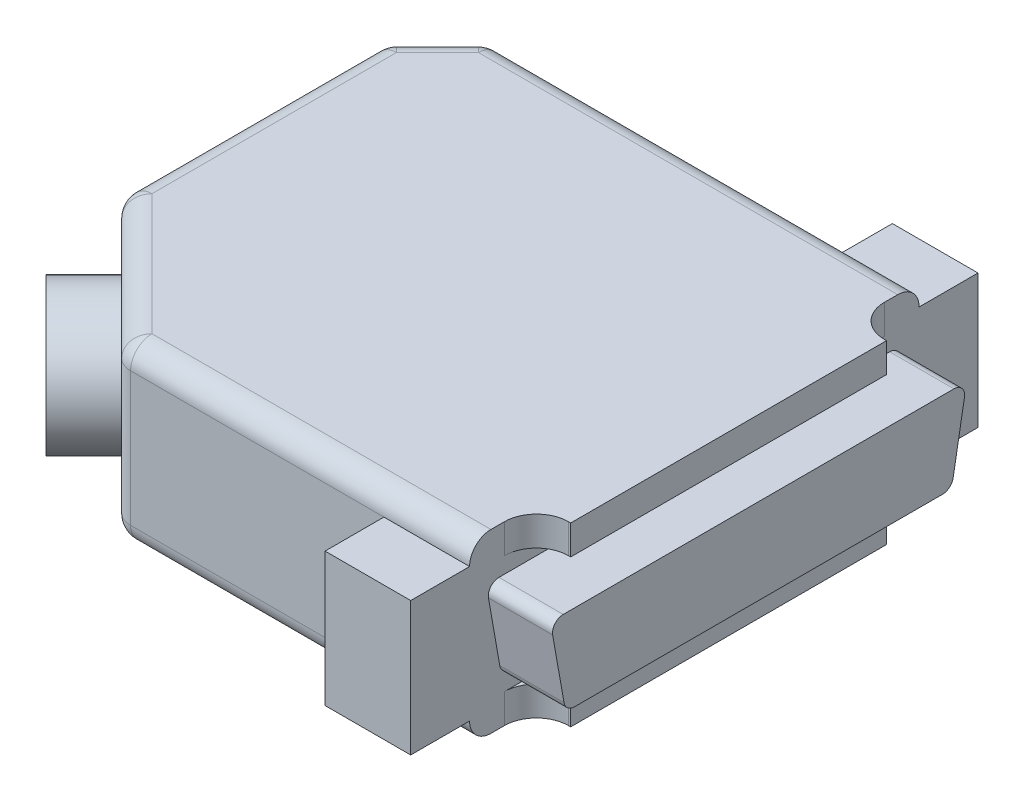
ISO-10303-21;
HEADER;
FILE_DESCRIPTION(('STEP AP214'),'2;1');
FILE_NAME('part.step','',(''),(''),'','','');
FILE_SCHEMA(('AUTOMOTIVE_DESIGN { 1 0 10303 214 1 1 1 1 }'));
ENDSEC;
DATA;
#1=APPLICATION_CONTEXT('core data for automotive mechanical design processes');
#2=APPLICATION_PROTOCOL_DEFINITION('international standard','automotive_design',2000,#1);
#3=PRODUCT_CONTEXT('',#1,'mechanical');
#4=PRODUCT('Part','Part','',(#3));
#5=PRODUCT_RELATED_PRODUCT_CATEGORY('part','',(#4));
#6=PRODUCT_DEFINITION_FORMATION('','',#4);
#7=PRODUCT_DEFINITION_CONTEXT('part definition',#1,'design');
#8=PRODUCT_DEFINITION('design','',#6,#7);
#9=PRODUCT_DEFINITION_SHAPE('','',#8);
#10=(LENGTH_UNIT() NAMED_UNIT(*) SI_UNIT(.MILLI.,.METRE.));
#11=(NAMED_UNIT(*) PLANE_ANGLE_UNIT() SI_UNIT($,.RADIAN.));
#12=(NAMED_UNIT(*) SI_UNIT($,.STERADIAN.) SOLID_ANGLE_UNIT());
#13=UNCERTAINTY_MEASURE_WITH_UNIT(LENGTH_MEASURE(1.E-05),#10,'distance_accuracy_value','');
#14=(GEOMETRIC_REPRESENTATION_CONTEXT(3) GLOBAL_UNCERTAINTY_ASSIGNED_CONTEXT((#13)) GLOBAL_UNIT_ASSIGNED_CONTEXT((#10,
#11,#12)) REPRESENTATION_CONTEXT('',''));
#15=CARTESIAN_POINT('',(0.,0.,0.));
#16=DIRECTION('',(0.,0.,1.));
#17=DIRECTION('',(1.,0.,0.));
#18=AXIS2_PLACEMENT_3D('',#15,#16,#17);
#19=CARTESIAN_POINT('',(3.,-8.25,14.75));
#20=DIRECTION('',(0.,0.,1.));
#21=DIRECTION('',(1.,0.,0.));
#22=AXIS2_PLACEMENT_3D('',#19,#20,#21);
#23=PLANE('',#22);
#24=DIRECTION('',(0.,1.,0.));
#25=VECTOR('',#24,1.);
#26=CARTESIAN_POINT('',(3.,-8.25,14.75));
#27=LINE('',#26,#25);
#28=CARTESIAN_POINT('',(3.,8.25,14.75));
#29=VERTEX_POINT('',#28);
#30=CARTESIAN_POINT('',(3.,5.5,14.75));
#31=VERTEX_POINT('',#30);
#32=EDGE_CURVE('E345',#29,#31,#27,.F.);
#33=ORIENTED_EDGE('',*,*,#32,.T.);
#34=DIRECTION('',(1.,0.,0.));
#35=VECTOR('',#34,1.);
#36=CARTESIAN_POINT('',(3.,5.5,14.75));
#37=LINE('',#36,#35);
#38=CARTESIAN_POINT('',(3.2,5.5,14.75));
#39=VERTEX_POINT('',#38);
#40=EDGE_CURVE('E380',#31,#39,#37,.T.);
#41=ORIENTED_EDGE('',*,*,#40,.T.);
#42=DIRECTION('',(0.,1.,0.));
#43=VECTOR('',#42,1.);
#44=CARTESIAN_POINT('',(3.2,-8.25,14.75));
#45=LINE('',#44,#43);
#46=CARTESIAN_POINT('',(3.2,8.25,14.75));
#47=VERTEX_POINT('',#46);
#48=EDGE_CURVE('E367',#47,#39,#45,.F.);
#49=ORIENTED_EDGE('',*,*,#48,.F.);
#50=DIRECTION('',(1.,0.,0.));
#51=VECTOR('',#50,1.);
#52=CARTESIAN_POINT('',(0.,8.25,14.75));
#53=LINE('',#52,#51);
#54=EDGE_CURVE('E392',#29,#47,#53,.T.);
#55=ORIENTED_EDGE('',*,*,#54,.F.);
#56=EDGE_LOOP('',(#33,#41,#49,#55));
#57=FACE_BOUND('',#56,.T.);
#58=ADVANCED_FACE('F16',(#57),#23,.T.);
#59=CARTESIAN_POINT('',(-31.67157287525,6.25,19.));
#60=DIRECTION('',(-0.499999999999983,0.707106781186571,0.499999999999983));
#61=DIRECTION('',(0.707106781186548,0.,0.707106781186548));
#62=AXIS2_PLACEMENT_3D('',#59,#60,#61);
#63=SPHERICAL_SURFACE('',#62,2.);
#64=CARTESIAN_POINT('',(-31.67157287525,6.25,19.));
#65=DIRECTION('',(0.,-1.,0.));
#66=DIRECTION('',(0.,0.,-1.));
#67=AXIS2_PLACEMENT_3D('',#64,#65,#66);
#68=CIRCLE('',#67,2.);
#69=CARTESIAN_POINT('',(-33.0857864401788,6.25000000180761,20.4142135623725));
#70=VERTEX_POINT('',#69);
#71=CARTESIAN_POINT('',(-31.67157287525,6.25,21.));
#72=VERTEX_POINT('',#71);
#73=EDGE_CURVE('E368',#70,#72,#68,.F.);
#74=ORIENTED_EDGE('',*,*,#73,.T.);
#75=CARTESIAN_POINT('',(-31.67157287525,6.25,19.));
#76=DIRECTION('',(-1.,0.,0.));
#77=DIRECTION('',(0.,0.,1.));
#78=AXIS2_PLACEMENT_3D('',#75,#76,#77);
#79=CIRCLE('',#78,2.);
#80=CARTESIAN_POINT('',(-31.671572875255,8.25,18.999999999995));
#81=VERTEX_POINT('',#80);
#82=EDGE_CURVE('E339',#81,#72,#79,.F.);
#83=ORIENTED_EDGE('',*,*,#82,.F.);
#84=CARTESIAN_POINT('',(-31.671572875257,6.25,18.999999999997));
#85=DIRECTION('',(0.707106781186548,0.,0.707106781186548));
#86=DIRECTION('',(0.707106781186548,0.,-0.707106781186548));
#87=AXIS2_PLACEMENT_3D('',#84,#85,#86);
#88=CIRCLE('',#87,2.);
#89=CARTESIAN_POINT('',(-32.671572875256,7.66421356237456,19.999999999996));
#90=VERTEX_POINT('',#89);
#91=EDGE_CURVE('E19',#81,#90,#88,.T.);
#92=ORIENTED_EDGE('',*,*,#91,.T.);
#93=CARTESIAN_POINT('',(-31.67157287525,6.25,19.));
#94=DIRECTION('',(0.707106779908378,-1.80760484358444E-09,0.707106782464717));
#95=DIRECTION('',(-0.499999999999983,0.707106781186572,0.499999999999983));
#96=AXIS2_PLACEMENT_3D('',#93,#94,#95);
#97=CIRCLE('',#96,2.);
#98=EDGE_CURVE('E370',#90,#70,#97,.T.);
#99=ORIENTED_EDGE('',*,*,#98,.T.);
#100=EDGE_LOOP('',(#74,#83,#92,#99));
#101=FACE_BOUND('',#100,.T.);
#102=ADVANCED_FACE('F1075',(#101),#63,.T.);
#103=CARTESIAN_POINT('',(3.2,-8.25,-14.75));
#104=DIRECTION('',(0.,0.,-1.));
#105=DIRECTION('',(-1.,0.,0.));
#106=AXIS2_PLACEMENT_3D('',#103,#104,#105);
#107=PLANE('',#106);
#108=DIRECTION('',(0.,1.,0.));
#109=VECTOR('',#108,1.);
#110=CARTESIAN_POINT('',(3.2,-8.25,-14.75));
#111=LINE('',#110,#109);
#112=CARTESIAN_POINT('',(3.2,5.5,-14.75));
#113=VERTEX_POINT('',#112);
#114=CARTESIAN_POINT('',(3.2,8.25,-14.75));
#115=VERTEX_POINT('',#114);
#116=EDGE_CURVE('E374',#113,#115,#111,.T.);
#117=ORIENTED_EDGE('',*,*,#116,.F.);
#118=DIRECTION('',(-1.,0.,0.));
#119=VECTOR('',#118,1.);
#120=CARTESIAN_POINT('',(3.2,5.5,-14.75));
#121=LINE('',#120,#119);
#122=CARTESIAN_POINT('',(3.,5.5,-14.75));
#123=VERTEX_POINT('',#122);
#124=EDGE_CURVE('E369',#113,#123,#121,.T.);
#125=ORIENTED_EDGE('',*,*,#124,.T.);
#126=DIRECTION('',(0.,1.,0.));
#127=VECTOR('',#126,1.);
#128=CARTESIAN_POINT('',(3.,-8.25,-14.75));
#129=LINE('',#128,#127);
#130=CARTESIAN_POINT('',(3.,8.25,-14.75));
#131=VERTEX_POINT('',#130);
#132=EDGE_CURVE('E338',#123,#131,#129,.T.);
#133=ORIENTED_EDGE('',*,*,#132,.T.);
#134=DIRECTION('',(1.,0.,0.));
#135=VECTOR('',#134,1.);
#136=CARTESIAN_POINT('',(0.,8.25,-14.75));
#137=LINE('',#136,#135);
#138=EDGE_CURVE('E391',#115,#131,#137,.F.);
#139=ORIENTED_EDGE('',*,*,#138,.F.);
#140=EDGE_LOOP('',(#117,#125,#133,#139));
#141=FACE_BOUND('',#140,.T.);
#142=ADVANCED_FACE('F1078',(#141),#107,.T.);
#143=CARTESIAN_POINT('',(3.2,-8.25,14.75));
#144=DIRECTION('',(1.,0.,0.));
#145=DIRECTION('',(0.,0.,-1.));
#146=AXIS2_PLACEMENT_3D('',#143,#144,#145);
#147=PLANE('',#146);
#148=ORIENTED_EDGE('',*,*,#48,.T.);
#149=DIRECTION('',(0.,0.,1.));
#150=VECTOR('',#149,1.);
#151=CARTESIAN_POINT('',(3.2,5.5,31.8));
#152=LINE('',#151,#150);
#153=EDGE_CURVE('E331',#39,#113,#152,.F.);
#154=ORIENTED_EDGE('',*,*,#153,.T.);
#155=ORIENTED_EDGE('',*,*,#116,.T.);
#156=DIRECTION('',(0.,0.,1.));
#157=VECTOR('',#156,1.);
#158=CARTESIAN_POINT('',(3.2,8.25,0.));
#159=LINE('',#158,#157);
#160=EDGE_CURVE('E388',#47,#115,#159,.F.);
#161=ORIENTED_EDGE('',*,*,#160,.F.);
#162=EDGE_LOOP('',(#148,#154,#155,#161));
#163=FACE_BOUND('',#162,.T.);
#164=ADVANCED_FACE('F1083',(#163),#147,.T.);
#165=CARTESIAN_POINT('',(0.,-3.,-17.19203811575));
#166=DIRECTION('',(1.,0.,0.));
#167=DIRECTION('',(0.,0.,-1.));
#168=AXIS2_PLACEMENT_3D('',#165,#166,#167);
#169=CYLINDRICAL_SURFACE('',#168,1.);
#170=DIRECTION('',(1.,0.,0.));
#171=VECTOR('',#170,1.);
#172=CARTESIAN_POINT('',(0.,-4.,-17.19203811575));
#173=LINE('',#172,#171);
#174=CARTESIAN_POINT('',(0.,-4.,-17.19203811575));
#175=VERTEX_POINT('',#174);
#176=CARTESIAN_POINT('',(6.,-4.,-17.19203811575));
#177=VERTEX_POINT('',#176);
#178=EDGE_CURVE('E534',#175,#177,#173,.T.);
#179=ORIENTED_EDGE('',*,*,#178,.F.);
#180=CARTESIAN_POINT('',(0.,-3.,-17.19203811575));
#181=DIRECTION('',(1.,0.,0.));
#182=DIRECTION('',(0.,0.,-1.));
#183=AXIS2_PLACEMENT_3D('',#180,#181,#182);
#184=CIRCLE('',#183,1.);
#185=CARTESIAN_POINT('',(0.,-3.17364817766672,-18.1768458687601));
#186=VERTEX_POINT('',#185);
#187=EDGE_CURVE('E366',#175,#186,#184,.T.);
#188=ORIENTED_EDGE('',*,*,#187,.T.);
#189=DIRECTION('',(1.,0.,0.));
#190=VECTOR('',#189,1.);
#191=CARTESIAN_POINT('',(0.,-3.173648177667,-18.17684586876));
#192=LINE('',#191,#190);
#193=CARTESIAN_POINT('',(6.,-3.17364817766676,-18.17684586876));
#194=VERTEX_POINT('',#193);
#195=EDGE_CURVE('E538',#194,#186,#192,.F.);
#196=ORIENTED_EDGE('',*,*,#195,.F.);
#197=CARTESIAN_POINT('',(6.,-3.,-17.19203811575));
#198=DIRECTION('',(1.,0.,0.));
#199=DIRECTION('',(0.,0.,-1.));
#200=AXIS2_PLACEMENT_3D('',#197,#198,#199);
#201=CIRCLE('',#200,1.);
#202=EDGE_CURVE('E360',#177,#194,#201,.T.);
#203=ORIENTED_EDGE('',*,*,#202,.F.);
#204=EDGE_LOOP('',(#179,#188,#196,#203));
#205=FACE_BOUND('',#204,.T.);
#206=ADVANCED_FACE('F1090',(#205),#169,.T.);
#207=CARTESIAN_POINT('',(0.,-3.,17.19203811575));
#208=DIRECTION('',(1.,0.,0.));
#209=DIRECTION('',(0.,0.,-1.));
#210=AXIS2_PLACEMENT_3D('',#207,#208,#209);
#211=CYLINDRICAL_SURFACE('',#210,1.);
#212=DIRECTION('',(1.,0.,0.));
#213=VECTOR('',#212,1.);
#214=CARTESIAN_POINT('',(0.,-3.17364817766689,18.1768458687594));
#215=LINE('',#214,#213);
#216=CARTESIAN_POINT('',(0.,-3.17364817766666,18.1768458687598));
#217=VERTEX_POINT('',#216);
#218=CARTESIAN_POINT('',(6.,-3.17364817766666,18.1768458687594));
#219=VERTEX_POINT('',#218);
#220=EDGE_CURVE('E529',#217,#219,#215,.T.);
#221=ORIENTED_EDGE('',*,*,#220,.F.);
#222=CARTESIAN_POINT('',(0.,-3.,17.19203811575));
#223=DIRECTION('',(1.,0.,0.));
#224=DIRECTION('',(0.,0.,-1.));
#225=AXIS2_PLACEMENT_3D('',#222,#223,#224);
#226=CIRCLE('',#225,1.);
#227=CARTESIAN_POINT('',(0.,-4.,17.19203811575));
#228=VERTEX_POINT('',#227);
#229=EDGE_CURVE('E364',#217,#228,#226,.T.);
#230=ORIENTED_EDGE('',*,*,#229,.T.);
#231=DIRECTION('',(1.,0.,0.));
#232=VECTOR('',#231,1.);
#233=CARTESIAN_POINT('',(0.,-4.,17.19203811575));
#234=LINE('',#233,#232);
#235=CARTESIAN_POINT('',(6.,-4.,17.19203811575));
#236=VERTEX_POINT('',#235);
#237=EDGE_CURVE('E533',#236,#228,#234,.F.);
#238=ORIENTED_EDGE('',*,*,#237,.F.);
#239=CARTESIAN_POINT('',(6.,-3.,17.19203811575));
#240=DIRECTION('',(1.,0.,0.));
#241=DIRECTION('',(0.,0.,-1.));
#242=AXIS2_PLACEMENT_3D('',#239,#240,#241);
#243=CIRCLE('',#242,1.);
#244=EDGE_CURVE('E362',#219,#236,#243,.T.);
#245=ORIENTED_EDGE('',*,*,#244,.F.);
#246=EDGE_LOOP('',(#221,#230,#238,#245));
#247=FACE_BOUND('',#246,.T.);
#248=ADVANCED_FACE('F1093',(#247),#211,.T.);
#249=CARTESIAN_POINT('',(6.,0.,0.));
#250=DIRECTION('',(1.,0.,0.));
#251=DIRECTION('',(0.,0.,-1.));
#252=AXIS2_PLACEMENT_3D('',#249,#250,#251);
#253=PLANE('',#252);
#254=DIRECTION('',(0.,0.,1.));
#255=VECTOR('',#254,1.);
#256=CARTESIAN_POINT('',(6.,4.,-18.25));
#257=LINE('',#256,#255);
#258=CARTESIAN_POINT('',(6.,4.,18.25));
#259=VERTEX_POINT('',#258);
#260=CARTESIAN_POINT('',(6.,4.,-18.25));
#261=VERTEX_POINT('',#260);
#262=EDGE_CURVE('E330',#259,#261,#257,.F.);
#263=ORIENTED_EDGE('',*,*,#262,.F.);
#264=CARTESIAN_POINT('',(6.,3.,18.25));
#265=DIRECTION('',(1.,0.,0.));
#266=DIRECTION('',(0.,0.,-1.));
#267=AXIS2_PLACEMENT_3D('',#264,#265,#266);
#268=CIRCLE('',#267,1.);
#269=CARTESIAN_POINT('',(6.,2.82635182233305,19.2348077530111));
#270=VERTEX_POINT('',#269);
#271=EDGE_CURVE('E319',#270,#259,#268,.F.);
#272=ORIENTED_EDGE('',*,*,#271,.F.);
#273=DIRECTION('',(0.,-0.984807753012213,-0.173648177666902));
#274=VECTOR('',#273,1.);
#275=CARTESIAN_POINT('',(6.,2.826351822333,19.23480775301));
#276=LINE('',#275,#274);
#277=EDGE_CURVE('E527',#219,#270,#276,.F.);
#278=ORIENTED_EDGE('',*,*,#277,.F.);
#279=ORIENTED_EDGE('',*,*,#244,.T.);
#280=DIRECTION('',(0.,0.,-1.));
#281=VECTOR('',#280,1.);
#282=CARTESIAN_POINT('',(6.,-4.,17.19203811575));
#283=LINE('',#282,#281);
#284=EDGE_CURVE('E530',#177,#236,#283,.F.);
#285=ORIENTED_EDGE('',*,*,#284,.F.);
#286=ORIENTED_EDGE('',*,*,#202,.T.);
#287=DIRECTION('',(0.,0.984807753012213,-0.173648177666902));
#288=VECTOR('',#287,1.);
#289=CARTESIAN_POINT('',(6.,-3.173648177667,-18.17684586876));
#290=LINE('',#289,#288);
#291=CARTESIAN_POINT('',(6.,2.82635182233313,-19.2348077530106));
#292=VERTEX_POINT('',#291);
#293=EDGE_CURVE('E535',#292,#194,#290,.F.);
#294=ORIENTED_EDGE('',*,*,#293,.F.);
#295=CARTESIAN_POINT('',(6.,3.,-18.25));
#296=DIRECTION('',(1.,0.,0.));
#297=DIRECTION('',(0.,0.,-1.));
#298=AXIS2_PLACEMENT_3D('',#295,#296,#297);
#299=CIRCLE('',#298,1.);
#300=EDGE_CURVE('E323',#261,#292,#299,.F.);
#301=ORIENTED_EDGE('',*,*,#300,.F.);
#302=EDGE_LOOP('',(#263,#272,#278,#279,#285,#286,#294,#301));
#303=FACE_BOUND('',#302,.T.);
#304=ADVANCED_FACE('F520',(#303),#253,.T.);
#305=CARTESIAN_POINT('',(-39.17157287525,6.25,-19.));
#306=DIRECTION('',(-0.499999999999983,0.707106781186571,-0.499999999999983));
#307=DIRECTION('',(0.707106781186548,0.,-0.707106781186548));
#308=AXIS2_PLACEMENT_3D('',#305,#306,#307);
#309=SPHERICAL_SURFACE('',#308,2.);
#310=CARTESIAN_POINT('',(-39.17157287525,6.25,-19.));
#311=DIRECTION('',(1.,0.,0.));
#312=DIRECTION('',(0.,0.,-1.));
#313=AXIS2_PLACEMENT_3D('',#310,#311,#312);
#314=CIRCLE('',#313,2.);
#315=CARTESIAN_POINT('',(-39.17157287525,6.25,-21.));
#316=VERTEX_POINT('',#315);
#317=CARTESIAN_POINT('',(-39.17157287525,8.25,-18.9999999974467));
#318=VERTEX_POINT('',#317);
#319=EDGE_CURVE('E314',#316,#318,#314,.T.);
#320=ORIENTED_EDGE('',*,*,#319,.F.);
#321=CARTESIAN_POINT('',(-39.17157287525,6.25,-19.));
#322=DIRECTION('',(0.,-1.,0.));
#323=DIRECTION('',(0.,0.,-1.));
#324=AXIS2_PLACEMENT_3D('',#321,#322,#323);
#325=CIRCLE('',#324,2.);
#326=CARTESIAN_POINT('',(-40.5857864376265,6.25,-20.4142135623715));
#327=VERTEX_POINT('',#326);
#328=EDGE_CURVE('E355',#316,#327,#325,.F.);
#329=ORIENTED_EDGE('',*,*,#328,.T.);
#330=CARTESIAN_POINT('',(-39.17157287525,6.25,-19.));
#331=DIRECTION('',(-0.707106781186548,0.,0.707106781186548));
#332=DIRECTION('',(0.707106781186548,0.,0.707106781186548));
#333=AXIS2_PLACEMENT_3D('',#330,#331,#332);
#334=CIRCLE('',#333,2.);
#335=CARTESIAN_POINT('',(-40.17157287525,7.66421356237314,-20.));
#336=VERTEX_POINT('',#335);
#337=EDGE_CURVE('E358',#327,#336,#334,.F.);
#338=ORIENTED_EDGE('',*,*,#337,.T.);
#339=CARTESIAN_POINT('',(-39.17157287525,6.25,-19.));
#340=DIRECTION('',(0.707106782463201,1.80546071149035E-09,-0.707106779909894));
#341=DIRECTION('',(-0.499999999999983,0.707106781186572,-0.499999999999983));
#342=AXIS2_PLACEMENT_3D('',#339,#340,#341);
#343=CIRCLE('',#342,2.);
#344=EDGE_CURVE('E357',#336,#318,#343,.T.);
#345=ORIENTED_EDGE('',*,*,#344,.T.);
#346=EDGE_LOOP('',(#320,#329,#338,#345));
#347=FACE_BOUND('',#346,.T.);
#348=ADVANCED_FACE('F514',(#347),#309,.T.);
#349=CARTESIAN_POINT('',(-43.,6.25,-15.17157287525));
#350=DIRECTION('',(-0.499999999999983,0.707106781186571,-0.499999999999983));
#351=DIRECTION('',(-0.707106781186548,0.,0.707106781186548));
#352=AXIS2_PLACEMENT_3D('',#349,#350,#351);
#353=SPHERICAL_SURFACE('',#352,2.);
#354=CARTESIAN_POINT('',(-43.,6.25,-15.17157287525));
#355=DIRECTION('',(0.,-1.,0.));
#356=DIRECTION('',(0.,0.,-1.));
#357=AXIS2_PLACEMENT_3D('',#354,#355,#356);
#358=CIRCLE('',#357,2.);
#359=CARTESIAN_POINT('',(-44.4142135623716,6.25,-16.5857864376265));
#360=VERTEX_POINT('',#359);
#361=CARTESIAN_POINT('',(-45.,6.25,-15.17157287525));
#362=VERTEX_POINT('',#361);
#363=EDGE_CURVE('E353',#360,#362,#358,.F.);
#364=ORIENTED_EDGE('',*,*,#363,.T.);
#365=CARTESIAN_POINT('',(-43.,6.25,-15.17157287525));
#366=DIRECTION('',(0.,0.,1.));
#367=DIRECTION('',(1.,0.,0.));
#368=AXIS2_PLACEMENT_3D('',#365,#366,#367);
#369=CIRCLE('',#368,2.);
#370=CARTESIAN_POINT('',(-42.999999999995,8.25,-15.17157287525));
#371=VERTEX_POINT('',#370);
#372=EDGE_CURVE('E305',#371,#362,#369,.T.);
#373=ORIENTED_EDGE('',*,*,#372,.F.);
#374=CARTESIAN_POINT('',(-42.999999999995,6.25,-15.171572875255));
#375=DIRECTION('',(-0.707106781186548,0.,0.707106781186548));
#376=DIRECTION('',(0.707106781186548,0.,0.707106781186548));
#377=AXIS2_PLACEMENT_3D('',#374,#375,#376);
#378=CIRCLE('',#377,2.);
#379=CARTESIAN_POINT('',(-43.999999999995,7.66421356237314,-16.171572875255));
#380=VERTEX_POINT('',#379);
#381=EDGE_CURVE('E312',#380,#371,#378,.F.);
#382=ORIENTED_EDGE('',*,*,#381,.F.);
#383=CARTESIAN_POINT('',(-42.999999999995,6.25,-15.171572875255));
#384=DIRECTION('',(-0.707106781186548,0.,0.707106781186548));
#385=DIRECTION('',(0.707106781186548,0.,0.707106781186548));
#386=AXIS2_PLACEMENT_3D('',#383,#384,#385);
#387=CIRCLE('',#386,2.);
#388=EDGE_CURVE('E34',#360,#380,#387,.F.);
#389=ORIENTED_EDGE('',*,*,#388,.F.);
#390=EDGE_LOOP('',(#364,#373,#382,#389));
#391=FACE_BOUND('',#390,.T.);
#392=ADVANCED_FACE('F509',(#391),#353,.T.);
#393=CARTESIAN_POINT('',(-43.,6.25,7.671572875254));
#394=DIRECTION('',(-0.499999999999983,0.707106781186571,0.499999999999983));
#395=DIRECTION('',(-0.707106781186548,0.,-0.707106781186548));
#396=AXIS2_PLACEMENT_3D('',#393,#394,#395);
#397=SPHERICAL_SURFACE('',#396,2.);
#398=CARTESIAN_POINT('',(-43.,6.25,7.671572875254));
#399=DIRECTION('',(0.,0.,1.));
#400=DIRECTION('',(1.,0.,0.));
#401=AXIS2_PLACEMENT_3D('',#398,#399,#400);
#402=CIRCLE('',#401,2.);
#403=CARTESIAN_POINT('',(-45.,6.25,7.671572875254));
#404=VERTEX_POINT('',#403);
#405=CARTESIAN_POINT('',(-42.9999999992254,8.25,7.671572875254));
#406=VERTEX_POINT('',#405);
#407=EDGE_CURVE('E308',#404,#406,#402,.F.);
#408=ORIENTED_EDGE('',*,*,#407,.F.);
#409=CARTESIAN_POINT('',(-43.,6.25,7.671572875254));
#410=DIRECTION('',(0.,-1.,0.));
#411=DIRECTION('',(0.,0.,-1.));
#412=AXIS2_PLACEMENT_3D('',#409,#410,#411);
#413=CIRCLE('',#412,2.);
#414=CARTESIAN_POINT('',(-44.4142135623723,6.25,9.0857864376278));
#415=VERTEX_POINT('',#414);
#416=EDGE_CURVE('E347',#404,#415,#413,.F.);
#417=ORIENTED_EDGE('',*,*,#416,.T.);
#418=CARTESIAN_POINT('',(-43.,6.25,7.671572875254));
#419=DIRECTION('',(0.707106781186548,0.,0.707106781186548));
#420=DIRECTION('',(0.707106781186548,0.,-0.707106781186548));
#421=AXIS2_PLACEMENT_3D('',#418,#419,#420);
#422=CIRCLE('',#421,2.);
#423=CARTESIAN_POINT('',(-44.,7.66421356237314,8.67157287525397));
#424=VERTEX_POINT('',#423);
#425=EDGE_CURVE('E351',#415,#424,#422,.F.);
#426=ORIENTED_EDGE('',*,*,#425,.T.);
#427=CARTESIAN_POINT('',(-43.,6.25,7.671572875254));
#428=DIRECTION('',(-0.70710678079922,5.4776455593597E-10,-0.707106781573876));
#429=DIRECTION('',(-0.499999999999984,0.707106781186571,0.499999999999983));
#430=AXIS2_PLACEMENT_3D('',#427,#428,#429);
#431=CIRCLE('',#430,2.);
#432=EDGE_CURVE('E350',#424,#406,#431,.T.);
#433=ORIENTED_EDGE('',*,*,#432,.T.);
#434=EDGE_LOOP('',(#408,#417,#426,#433));
#435=FACE_BOUND('',#434,.T.);
#436=ADVANCED_FACE('F513',(#435),#397,.T.);
#437=CARTESIAN_POINT('',(0.,8.25,0.));
#438=DIRECTION('',(0.,1.,0.));
#439=DIRECTION('',(0.,0.,1.));
#440=AXIS2_PLACEMENT_3D('',#437,#438,#439);
#441=PLANE('',#440);
#442=DIRECTION('',(0.707106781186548,0.,0.707106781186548));
#443=VECTOR('',#442,1.);
#444=CARTESIAN_POINT('',(-42.999999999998,8.25,7.671572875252));
#445=LINE('',#444,#443);
#446=EDGE_CURVE('E489',#81,#406,#445,.F.);
#447=ORIENTED_EDGE('',*,*,#446,.F.);
#448=DIRECTION('',(-1.,0.,0.));
#449=VECTOR('',#448,1.);
#450=CARTESIAN_POINT('',(-34.5,8.25,19.));
#451=LINE('',#450,#449);
#452=CARTESIAN_POINT('',(0.,8.25,19.));
#453=VERTEX_POINT('',#452);
#454=EDGE_CURVE('E161',#453,#81,#451,.T.);
#455=ORIENTED_EDGE('',*,*,#454,.F.);
#456=DIRECTION('',(0.,0.,1.));
#457=VECTOR('',#456,1.);
#458=CARTESIAN_POINT('',(0.,8.25,0.));
#459=LINE('',#458,#457);
#460=CARTESIAN_POINT('',(0.,8.25,17.75));
#461=VERTEX_POINT('',#460);
#462=EDGE_CURVE('E349',#453,#461,#459,.F.);
#463=ORIENTED_EDGE('',*,*,#462,.T.);
#464=CARTESIAN_POINT('',(3.,8.25,17.75));
#465=DIRECTION('',(0.,1.,0.));
#466=DIRECTION('',(0.,0.,1.));
#467=AXIS2_PLACEMENT_3D('',#464,#465,#466);
#468=CIRCLE('',#467,3.);
#469=EDGE_CURVE('E342',#461,#29,#468,.F.);
#470=ORIENTED_EDGE('',*,*,#469,.T.);
#471=ORIENTED_EDGE('',*,*,#54,.T.);
#472=ORIENTED_EDGE('',*,*,#160,.T.);
#473=ORIENTED_EDGE('',*,*,#138,.T.);
#474=CARTESIAN_POINT('',(3.,8.25,-17.75));
#475=DIRECTION('',(0.,1.,0.));
#476=DIRECTION('',(0.,0.,1.));
#477=AXIS2_PLACEMENT_3D('',#474,#475,#476);
#478=CIRCLE('',#477,3.);
#479=CARTESIAN_POINT('',(0.,8.25,-17.75));
#480=VERTEX_POINT('',#479);
#481=EDGE_CURVE('E335',#131,#480,#478,.F.);
#482=ORIENTED_EDGE('',*,*,#481,.T.);
#483=DIRECTION('',(0.,0.,1.));
#484=VECTOR('',#483,1.);
#485=CARTESIAN_POINT('',(0.,8.25,0.));
#486=LINE('',#485,#484);
#487=CARTESIAN_POINT('',(0.,8.25,-19.));
#488=VERTEX_POINT('',#487);
#489=EDGE_CURVE('E346',#480,#488,#486,.F.);
#490=ORIENTED_EDGE('',*,*,#489,.T.);
#491=DIRECTION('',(1.,0.,0.));
#492=VECTOR('',#491,1.);
#493=CARTESIAN_POINT('',(0.,8.25,-19.));
#494=LINE('',#493,#492);
#495=EDGE_CURVE('E317',#318,#488,#494,.T.);
#496=ORIENTED_EDGE('',*,*,#495,.F.);
#497=DIRECTION('',(-0.707106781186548,0.,0.707106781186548));
#498=VECTOR('',#497,1.);
#499=CARTESIAN_POINT('',(-39.17157287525,8.25,-19.));
#500=LINE('',#499,#498);
#501=EDGE_CURVE('E300',#371,#318,#500,.F.);
#502=ORIENTED_EDGE('',*,*,#501,.F.);
#503=DIRECTION('',(0.,0.,1.));
#504=VECTOR('',#503,1.);
#505=CARTESIAN_POINT('',(-43.,8.25,-18.));
#506=LINE('',#505,#504);
#507=EDGE_CURVE('E492',#406,#371,#506,.F.);
#508=ORIENTED_EDGE('',*,*,#507,.F.);
#509=EDGE_LOOP('',(#447,#455,#463,#470,#471,#472,#473,#482,#490,#496,#502,#508));
#510=FACE_BOUND('',#509,.T.);
#511=ADVANCED_FACE('F610',(#510),#441,.T.);
#512=CARTESIAN_POINT('',(-42.3063491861,0.,18.26471862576));
#513=DIRECTION('',(-0.707106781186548,0.,0.707106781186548));
#514=DIRECTION('',(0.707106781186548,0.,0.707106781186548));
#515=AXIS2_PLACEMENT_3D('',#512,#513,#514);
#516=PLANE('',#515);
#517=CARTESIAN_POINT('',(-42.3063491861,0.,18.26471862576));
#518=DIRECTION('',(-0.707106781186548,0.,0.707106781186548));
#519=DIRECTION('',(0.707106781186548,0.,0.707106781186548));
#520=AXIS2_PLACEMENT_3D('',#517,#518,#519);
#521=CIRCLE('',#520,6.);
#522=CARTESIAN_POINT('',(-38.0637084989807,0.,22.5073593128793));
#523=VERTEX_POINT('',#522);
#524=EDGE_CURVE('E481',#523,#523,#521,.F.);
#525=ORIENTED_EDGE('',*,*,#524,.F.);
#526=EDGE_LOOP('',(#525));
#527=FACE_BOUND('',#526,.T.);
#528=ADVANCED_FACE('F773',(#527),#516,.T.);
#529=CARTESIAN_POINT('',(-8.,-8.25,21.));
#530=DIRECTION('',(-1.,0.,0.));
#531=DIRECTION('',(0.,0.,1.));
#532=AXIS2_PLACEMENT_3D('',#529,#530,#531);
#533=PLANE('',#532);
#534=DIRECTION('',(0.,1.,0.));
#535=VECTOR('',#534,1.);
#536=CARTESIAN_POINT('',(-8.,-8.25,26.5));
#537=LINE('',#536,#535);
#538=CARTESIAN_POINT('',(-8.,6.25,26.5));
#539=VERTEX_POINT('',#538);
#540=CARTESIAN_POINT('',(-8.,-6.25,26.5));
#541=VERTEX_POINT('',#540);
#542=EDGE_CURVE('E551',#539,#541,#537,.F.);
#543=ORIENTED_EDGE('',*,*,#542,.F.);
#544=DIRECTION('',(0.,0.,-1.));
#545=VECTOR('',#544,1.);
#546=CARTESIAN_POINT('',(-8.,6.25,26.5));
#547=LINE('',#546,#545);
#548=CARTESIAN_POINT('',(-8.,6.25,21.));
#549=VERTEX_POINT('',#548);
#550=EDGE_CURVE('E341',#539,#549,#547,.T.);
#551=ORIENTED_EDGE('',*,*,#550,.T.);
#552=DIRECTION('',(0.,1.,0.));
#553=VECTOR('',#552,1.);
#554=CARTESIAN_POINT('',(-8.,-8.25,21.));
#555=LINE('',#554,#553);
#556=CARTESIAN_POINT('',(-8.,-6.25,21.));
#557=VERTEX_POINT('',#556);
#558=EDGE_CURVE('E484',#557,#549,#555,.T.);
#559=ORIENTED_EDGE('',*,*,#558,.F.);
#560=DIRECTION('',(0.,0.,1.));
#561=VECTOR('',#560,1.);
#562=CARTESIAN_POINT('',(-8.,-6.25,21.));
#563=LINE('',#562,#561);
#564=EDGE_CURVE('E949',#557,#541,#563,.T.);
#565=ORIENTED_EDGE('',*,*,#564,.T.);
#566=EDGE_LOOP('',(#543,#551,#559,#565));
#567=FACE_BOUND('',#566,.T.);
#568=ADVANCED_FACE('F769',(#567),#533,.T.);
#569=CARTESIAN_POINT('',(3.,-8.25,17.75));
#570=DIRECTION('',(0.,1.,0.));
#571=DIRECTION('',(0.,0.,1.));
#572=AXIS2_PLACEMENT_3D('',#569,#570,#571);
#573=CYLINDRICAL_SURFACE('',#572,3.);
#574=ORIENTED_EDGE('',*,*,#469,.F.);
#575=DIRECTION('',(0.,1.,0.));
#576=VECTOR('',#575,1.);
#577=CARTESIAN_POINT('',(0.,-8.25,17.75));
#578=LINE('',#577,#576);
#579=CARTESIAN_POINT('',(0.,5.5,17.75));
#580=VERTEX_POINT('',#579);
#581=EDGE_CURVE('E480',#580,#461,#578,.T.);
#582=ORIENTED_EDGE('',*,*,#581,.F.);
#583=CARTESIAN_POINT('',(3.,5.5,17.75));
#584=DIRECTION('',(0.,1.,0.));
#585=DIRECTION('',(0.,0.,1.));
#586=AXIS2_PLACEMENT_3D('',#583,#584,#585);
#587=CIRCLE('',#586,3.);
#588=EDGE_CURVE('E332',#580,#31,#587,.F.);
#589=ORIENTED_EDGE('',*,*,#588,.T.);
#590=ORIENTED_EDGE('',*,*,#32,.F.);
#591=EDGE_LOOP('',(#574,#582,#589,#590));
#592=FACE_BOUND('',#591,.T.);
#593=ADVANCED_FACE('F766',(#592),#573,.F.);
#594=CARTESIAN_POINT('',(-34.5,6.25,19.));
#595=DIRECTION('',(-1.,0.,0.));
#596=DIRECTION('',(0.,0.,1.));
#597=AXIS2_PLACEMENT_3D('',#594,#595,#596);
#598=CYLINDRICAL_SURFACE('',#597,2.);
#599=ORIENTED_EDGE('',*,*,#82,.T.);
#600=DIRECTION('',(1.,0.,0.));
#601=VECTOR('',#600,1.);
#602=CARTESIAN_POINT('',(-32.5,6.25,21.));
#603=LINE('',#602,#601);
#604=EDGE_CURVE('E589',#549,#72,#603,.F.);
#605=ORIENTED_EDGE('',*,*,#604,.F.);
#606=DIRECTION('',(1.,0.,0.));
#607=VECTOR('',#606,1.);
#608=CARTESIAN_POINT('',(0.,6.25,21.));
#609=LINE('',#608,#607);
#610=CARTESIAN_POINT('',(0.,6.25,21.));
#611=VERTEX_POINT('',#610);
#612=EDGE_CURVE('E169',#549,#611,#609,.T.);
#613=ORIENTED_EDGE('',*,*,#612,.T.);
#614=CARTESIAN_POINT('',(0.,6.25,19.));
#615=DIRECTION('',(-1.,0.,0.));
#616=DIRECTION('',(0.,0.,1.));
#617=AXIS2_PLACEMENT_3D('',#614,#615,#616);
#618=CIRCLE('',#617,2.);
#619=EDGE_CURVE('E477',#453,#611,#618,.F.);
#620=ORIENTED_EDGE('',*,*,#619,.F.);
#621=ORIENTED_EDGE('',*,*,#454,.T.);
#622=EDGE_LOOP('',(#599,#605,#613,#620,#621));
#623=FACE_BOUND('',#622,.T.);
#624=ADVANCED_FACE('F763',(#623),#598,.T.);
#625=CARTESIAN_POINT('',(0.,6.25,26.5));
#626=DIRECTION('',(0.,-1.,0.));
#627=DIRECTION('',(0.,0.,-1.));
#628=AXIS2_PLACEMENT_3D('',#625,#626,#627);
#629=PLANE('',#628);
#630=DIRECTION('',(0.,0.,-1.));
#631=VECTOR('',#630,1.);
#632=CARTESIAN_POINT('',(0.,6.25,26.5));
#633=LINE('',#632,#631);
#634=CARTESIAN_POINT('',(0.,6.25,26.5));
#635=VERTEX_POINT('',#634);
#636=EDGE_CURVE('E479',#611,#635,#633,.F.);
#637=ORIENTED_EDGE('',*,*,#636,.F.);
#638=ORIENTED_EDGE('',*,*,#612,.F.);
#639=ORIENTED_EDGE('',*,*,#550,.F.);
#640=DIRECTION('',(1.,0.,0.));
#641=VECTOR('',#640,1.);
#642=CARTESIAN_POINT('',(-8.,6.25,26.5));
#643=LINE('',#642,#641);
#644=EDGE_CURVE('E554',#635,#539,#643,.F.);
#645=ORIENTED_EDGE('',*,*,#644,.F.);
#646=EDGE_LOOP('',(#637,#638,#639,#645));
#647=FACE_BOUND('',#646,.T.);
#648=ADVANCED_FACE('F759',(#647),#629,.F.);
#649=CARTESIAN_POINT('',(-8.,-8.25,26.5));
#650=DIRECTION('',(0.,0.,1.));
#651=DIRECTION('',(1.,0.,0.));
#652=AXIS2_PLACEMENT_3D('',#649,#650,#651);
#653=PLANE('',#652);
#654=DIRECTION('',(0.,1.,0.));
#655=VECTOR('',#654,1.);
#656=CARTESIAN_POINT('',(0.,-8.25,26.5));
#657=LINE('',#656,#655);
#658=CARTESIAN_POINT('',(0.,-6.25,26.5));
#659=VERTEX_POINT('',#658);
#660=EDGE_CURVE('E899',#635,#659,#657,.F.);
#661=ORIENTED_EDGE('',*,*,#660,.F.);
#662=ORIENTED_EDGE('',*,*,#644,.T.);
#663=ORIENTED_EDGE('',*,*,#542,.T.);
#664=DIRECTION('',(1.,0.,0.));
#665=VECTOR('',#664,1.);
#666=CARTESIAN_POINT('',(0.,-6.25,26.5));
#667=LINE('',#666,#665);
#668=EDGE_CURVE('E937',#541,#659,#667,.T.);
#669=ORIENTED_EDGE('',*,*,#668,.T.);
#670=EDGE_LOOP('',(#661,#662,#663,#669));
#671=FACE_BOUND('',#670,.T.);
#672=ADVANCED_FACE('F755',(#671),#653,.T.);
#673=CARTESIAN_POINT('',(0.,-8.25,-26.5));
#674=DIRECTION('',(0.,0.,-1.));
#675=DIRECTION('',(-1.,0.,0.));
#676=AXIS2_PLACEMENT_3D('',#673,#674,#675);
#677=PLANE('',#676);
#678=DIRECTION('',(0.,1.,0.));
#679=VECTOR('',#678,1.);
#680=CARTESIAN_POINT('',(-8.,-8.25,-26.5));
#681=LINE('',#680,#679);
#682=CARTESIAN_POINT('',(-8.,6.25,-26.5));
#683=VERTEX_POINT('',#682);
#684=CARTESIAN_POINT('',(-8.,-6.25,-26.5));
#685=VERTEX_POINT('',#684);
#686=EDGE_CURVE('E563',#683,#685,#681,.F.);
#687=ORIENTED_EDGE('',*,*,#686,.F.);
#688=DIRECTION('',(1.,0.,0.));
#689=VECTOR('',#688,1.);
#690=CARTESIAN_POINT('',(0.,6.25,-26.5));
#691=LINE('',#690,#689);
#692=CARTESIAN_POINT('',(0.,6.25,-26.5));
#693=VERTEX_POINT('',#692);
#694=EDGE_CURVE('E541',#683,#693,#691,.T.);
#695=ORIENTED_EDGE('',*,*,#694,.T.);
#696=DIRECTION('',(0.,1.,0.));
#697=VECTOR('',#696,1.);
#698=CARTESIAN_POINT('',(0.,-8.25,-26.5));
#699=LINE('',#698,#697);
#700=CARTESIAN_POINT('',(0.,-6.25,-26.5));
#701=VERTEX_POINT('',#700);
#702=EDGE_CURVE('E884',#701,#693,#699,.T.);
#703=ORIENTED_EDGE('',*,*,#702,.F.);
#704=DIRECTION('',(1.,0.,0.));
#705=VECTOR('',#704,1.);
#706=CARTESIAN_POINT('',(0.,-6.25,-26.5));
#707=LINE('',#706,#705);
#708=EDGE_CURVE('E913',#701,#685,#707,.F.);
#709=ORIENTED_EDGE('',*,*,#708,.T.);
#710=EDGE_LOOP('',(#687,#695,#703,#709));
#711=FACE_BOUND('',#710,.T.);
#712=ADVANCED_FACE('F751',(#711),#677,.T.);
#713=CARTESIAN_POINT('',(0.,6.25,-21.));
#714=DIRECTION('',(0.,-1.,0.));
#715=DIRECTION('',(0.,0.,-1.));
#716=AXIS2_PLACEMENT_3D('',#713,#714,#715);
#717=PLANE('',#716);
#718=DIRECTION('',(1.,0.,0.));
#719=VECTOR('',#718,1.);
#720=CARTESIAN_POINT('',(0.,6.25,-21.));
#721=LINE('',#720,#719);
#722=CARTESIAN_POINT('',(0.,6.25,-21.));
#723=VERTEX_POINT('',#722);
#724=CARTESIAN_POINT('',(-8.,6.25,-21.));
#725=VERTEX_POINT('',#724);
#726=EDGE_CURVE('E964',#723,#725,#721,.F.);
#727=ORIENTED_EDGE('',*,*,#726,.F.);
#728=DIRECTION('',(0.,0.,-1.));
#729=VECTOR('',#728,1.);
#730=CARTESIAN_POINT('',(0.,6.25,26.5));
#731=LINE('',#730,#729);
#732=EDGE_CURVE('E476',#693,#723,#731,.F.);
#733=ORIENTED_EDGE('',*,*,#732,.F.);
#734=ORIENTED_EDGE('',*,*,#694,.F.);
#735=DIRECTION('',(0.,0.,1.));
#736=VECTOR('',#735,1.);
#737=CARTESIAN_POINT('',(-8.,6.25,-26.5));
#738=LINE('',#737,#736);
#739=EDGE_CURVE('E318',#725,#683,#738,.F.);
#740=ORIENTED_EDGE('',*,*,#739,.F.);
#741=EDGE_LOOP('',(#727,#733,#734,#740));
#742=FACE_BOUND('',#741,.T.);
#743=ADVANCED_FACE('F747',(#742),#717,.F.);
#744=CARTESIAN_POINT('',(3.,-8.25,-17.75));
#745=DIRECTION('',(0.,1.,0.));
#746=DIRECTION('',(0.,0.,1.));
#747=AXIS2_PLACEMENT_3D('',#744,#745,#746);
#748=CYLINDRICAL_SURFACE('',#747,3.);
#749=ORIENTED_EDGE('',*,*,#481,.F.);
#750=ORIENTED_EDGE('',*,*,#132,.F.);
#751=CARTESIAN_POINT('',(3.,5.5,-17.75));
#752=DIRECTION('',(0.,1.,0.));
#753=DIRECTION('',(0.,0.,1.));
#754=AXIS2_PLACEMENT_3D('',#751,#752,#753);
#755=CIRCLE('',#754,3.);
#756=CARTESIAN_POINT('',(0.,5.5,-17.75));
#757=VERTEX_POINT('',#756);
#758=EDGE_CURVE('E327',#123,#757,#755,.F.);
#759=ORIENTED_EDGE('',*,*,#758,.T.);
#760=DIRECTION('',(0.,1.,0.));
#761=VECTOR('',#760,1.);
#762=CARTESIAN_POINT('',(0.,-8.25,-17.75));
#763=LINE('',#762,#761);
#764=EDGE_CURVE('E475',#480,#757,#763,.F.);
#765=ORIENTED_EDGE('',*,*,#764,.F.);
#766=EDGE_LOOP('',(#749,#750,#759,#765));
#767=FACE_BOUND('',#766,.T.);
#768=ADVANCED_FACE('F743',(#767),#748,.F.);
#769=CARTESIAN_POINT('',(3.2,5.5,31.8));
#770=DIRECTION('',(0.,1.,0.));
#771=DIRECTION('',(0.,0.,1.));
#772=AXIS2_PLACEMENT_3D('',#769,#770,#771);
#773=PLANE('',#772);
#774=ORIENTED_EDGE('',*,*,#758,.F.);
#775=ORIENTED_EDGE('',*,*,#124,.F.);
#776=ORIENTED_EDGE('',*,*,#153,.F.);
#777=ORIENTED_EDGE('',*,*,#40,.F.);
#778=ORIENTED_EDGE('',*,*,#588,.F.);
#779=DIRECTION('',(0.,0.,-1.));
#780=VECTOR('',#779,1.);
#781=CARTESIAN_POINT('',(0.,5.5,26.5));
#782=LINE('',#781,#780);
#783=EDGE_CURVE('E882',#757,#580,#782,.F.);
#784=ORIENTED_EDGE('',*,*,#783,.F.);
#785=EDGE_LOOP('',(#774,#775,#776,#777,#778,#784));
#786=FACE_BOUND('',#785,.T.);
#787=ADVANCED_FACE('F739',(#786),#773,.F.);
#788=CARTESIAN_POINT('',(0.,4.,-18.25));
#789=DIRECTION('',(0.,1.,0.));
#790=DIRECTION('',(0.,0.,1.));
#791=AXIS2_PLACEMENT_3D('',#788,#789,#790);
#792=PLANE('',#791);
#793=DIRECTION('',(1.,0.,0.));
#794=VECTOR('',#793,1.);
#795=CARTESIAN_POINT('',(0.,4.,-18.25));
#796=LINE('',#795,#794);
#797=CARTESIAN_POINT('',(0.,4.,-18.25));
#798=VERTEX_POINT('',#797);
#799=EDGE_CURVE('E326',#798,#261,#796,.T.);
#800=ORIENTED_EDGE('',*,*,#799,.F.);
#801=DIRECTION('',(0.,0.,-1.));
#802=VECTOR('',#801,1.);
#803=CARTESIAN_POINT('',(0.,4.,26.5));
#804=LINE('',#803,#802);
#805=CARTESIAN_POINT('',(0.,4.,18.25));
#806=VERTEX_POINT('',#805);
#807=EDGE_CURVE('E471',#806,#798,#804,.T.);
#808=ORIENTED_EDGE('',*,*,#807,.F.);
#809=DIRECTION('',(1.,0.,0.));
#810=VECTOR('',#809,1.);
#811=CARTESIAN_POINT('',(0.,4.,18.25));
#812=LINE('',#811,#810);
#813=EDGE_CURVE('E321',#259,#806,#812,.F.);
#814=ORIENTED_EDGE('',*,*,#813,.F.);
#815=ORIENTED_EDGE('',*,*,#262,.T.);
#816=EDGE_LOOP('',(#800,#808,#814,#815));
#817=FACE_BOUND('',#816,.T.);
#818=ADVANCED_FACE('F735',(#817),#792,.T.);
#819=CARTESIAN_POINT('',(0.,3.,-18.25));
#820=DIRECTION('',(1.,0.,0.));
#821=DIRECTION('',(0.,0.,-1.));
#822=AXIS2_PLACEMENT_3D('',#819,#820,#821);
#823=CYLINDRICAL_SURFACE('',#822,1.);
#824=DIRECTION('',(1.,0.,0.));
#825=VECTOR('',#824,1.);
#826=CARTESIAN_POINT('',(0.,2.8263518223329,-19.2348077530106));
#827=LINE('',#826,#825);
#828=CARTESIAN_POINT('',(0.,2.82635182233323,-19.2348077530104));
#829=VERTEX_POINT('',#828);
#830=EDGE_CURVE('E325',#829,#292,#827,.T.);
#831=ORIENTED_EDGE('',*,*,#830,.F.);
#832=CARTESIAN_POINT('',(0.,3.,-18.25));
#833=DIRECTION('',(1.,0.,0.));
#834=DIRECTION('',(0.,0.,-1.));
#835=AXIS2_PLACEMENT_3D('',#832,#833,#834);
#836=CIRCLE('',#835,1.);
#837=EDGE_CURVE('E468',#798,#829,#836,.F.);
#838=ORIENTED_EDGE('',*,*,#837,.F.);
#839=ORIENTED_EDGE('',*,*,#799,.T.);
#840=ORIENTED_EDGE('',*,*,#300,.T.);
#841=EDGE_LOOP('',(#831,#838,#839,#840));
#842=FACE_BOUND('',#841,.T.);
#843=ADVANCED_FACE('F731',(#842),#823,.T.);
#844=CARTESIAN_POINT('',(0.,-3.173648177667,-18.17684586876));
#845=DIRECTION('',(0.,-0.173648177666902,-0.984807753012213));
#846=DIRECTION('',(0.,0.984807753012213,-0.173648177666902));
#847=AXIS2_PLACEMENT_3D('',#844,#845,#846);
#848=PLANE('',#847);
#849=ORIENTED_EDGE('',*,*,#195,.T.);
#850=DIRECTION('',(0.,-0.98480775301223,0.173648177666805));
#851=VECTOR('',#850,1.);
#852=CARTESIAN_POINT('',(0.,2.826351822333,-19.23480775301));
#853=LINE('',#852,#851);
#854=EDGE_CURVE('E470',#829,#186,#853,.T.);
#855=ORIENTED_EDGE('',*,*,#854,.F.);
#856=ORIENTED_EDGE('',*,*,#830,.T.);
#857=ORIENTED_EDGE('',*,*,#293,.T.);
#858=EDGE_LOOP('',(#849,#855,#856,#857));
#859=FACE_BOUND('',#858,.T.);
#860=ADVANCED_FACE('F727',(#859),#848,.T.);
#861=CARTESIAN_POINT('',(0.,-4.,17.19203811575));
#862=DIRECTION('',(0.,-1.,0.));
#863=DIRECTION('',(0.,0.,-1.));
#864=AXIS2_PLACEMENT_3D('',#861,#862,#863);
#865=PLANE('',#864);
#866=ORIENTED_EDGE('',*,*,#237,.T.);
#867=DIRECTION('',(0.,0.,-1.));
#868=VECTOR('',#867,1.);
#869=CARTESIAN_POINT('',(0.,-4.,26.5));
#870=LINE('',#869,#868);
#871=EDGE_CURVE('E876',#175,#228,#870,.F.);
#872=ORIENTED_EDGE('',*,*,#871,.F.);
#873=ORIENTED_EDGE('',*,*,#178,.T.);
#874=ORIENTED_EDGE('',*,*,#284,.T.);
#875=EDGE_LOOP('',(#866,#872,#873,#874));
#876=FACE_BOUND('',#875,.T.);
#877=ADVANCED_FACE('F723',(#876),#865,.T.);
#878=CARTESIAN_POINT('',(0.,2.826351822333,19.23480775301));
#879=DIRECTION('',(0.,-0.173648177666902,0.984807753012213));
#880=DIRECTION('',(0.,-0.984807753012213,-0.173648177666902));
#881=AXIS2_PLACEMENT_3D('',#878,#879,#880);
#882=PLANE('',#881);
#883=DIRECTION('',(1.,0.,0.));
#884=VECTOR('',#883,1.);
#885=CARTESIAN_POINT('',(0.,2.82635182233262,19.2348077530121));
#886=LINE('',#885,#884);
#887=CARTESIAN_POINT('',(0.,2.8263518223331,19.2348077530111));
#888=VERTEX_POINT('',#887);
#889=EDGE_CURVE('E322',#888,#270,#886,.T.);
#890=ORIENTED_EDGE('',*,*,#889,.F.);
#891=DIRECTION('',(0.,0.98480775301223,0.173648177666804));
#892=VECTOR('',#891,1.);
#893=CARTESIAN_POINT('',(0.,-3.173648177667,18.17684586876));
#894=LINE('',#893,#892);
#895=EDGE_CURVE('E467',#217,#888,#894,.T.);
#896=ORIENTED_EDGE('',*,*,#895,.F.);
#897=ORIENTED_EDGE('',*,*,#220,.T.);
#898=ORIENTED_EDGE('',*,*,#277,.T.);
#899=EDGE_LOOP('',(#890,#896,#897,#898));
#900=FACE_BOUND('',#899,.T.);
#901=ADVANCED_FACE('F719',(#900),#882,.T.);
#902=CARTESIAN_POINT('',(0.,3.,18.25));
#903=DIRECTION('',(1.,0.,0.));
#904=DIRECTION('',(0.,0.,-1.));
#905=AXIS2_PLACEMENT_3D('',#902,#903,#904);
#906=CYLINDRICAL_SURFACE('',#905,1.);
#907=ORIENTED_EDGE('',*,*,#813,.T.);
#908=CARTESIAN_POINT('',(0.,3.,18.25));
#909=DIRECTION('',(1.,0.,0.));
#910=DIRECTION('',(0.,0.,-1.));
#911=AXIS2_PLACEMENT_3D('',#908,#909,#910);
#912=CIRCLE('',#911,1.);
#913=EDGE_CURVE('E463',#888,#806,#912,.F.);
#914=ORIENTED_EDGE('',*,*,#913,.F.);
#915=ORIENTED_EDGE('',*,*,#889,.T.);
#916=ORIENTED_EDGE('',*,*,#271,.T.);
#917=EDGE_LOOP('',(#907,#914,#915,#916));
#918=FACE_BOUND('',#917,.T.);
#919=ADVANCED_FACE('F715',(#918),#906,.T.);
#920=CARTESIAN_POINT('',(-8.,-8.25,-26.5));
#921=DIRECTION('',(-1.,0.,0.));
#922=DIRECTION('',(0.,0.,1.));
#923=AXIS2_PLACEMENT_3D('',#920,#921,#922);
#924=PLANE('',#923);
#925=DIRECTION('',(0.,1.,0.));
#926=VECTOR('',#925,1.);
#927=CARTESIAN_POINT('',(-8.,-8.25,-21.));
#928=LINE('',#927,#926);
#929=CARTESIAN_POINT('',(-8.,-6.25,-21.));
#930=VERTEX_POINT('',#929);
#931=EDGE_CURVE('E466',#725,#930,#928,.F.);
#932=ORIENTED_EDGE('',*,*,#931,.F.);
#933=ORIENTED_EDGE('',*,*,#739,.T.);
#934=ORIENTED_EDGE('',*,*,#686,.T.);
#935=DIRECTION('',(0.,0.,1.));
#936=VECTOR('',#935,1.);
#937=CARTESIAN_POINT('',(-8.,-6.25,-26.5));
#938=LINE('',#937,#936);
#939=EDGE_CURVE('E910',#685,#930,#938,.T.);
#940=ORIENTED_EDGE('',*,*,#939,.T.);
#941=EDGE_LOOP('',(#932,#933,#934,#940));
#942=FACE_BOUND('',#941,.T.);
#943=ADVANCED_FACE('F711',(#942),#924,.T.);
#944=CARTESIAN_POINT('',(0.,6.25,-19.));
#945=DIRECTION('',(1.,0.,0.));
#946=DIRECTION('',(0.,0.,-1.));
#947=AXIS2_PLACEMENT_3D('',#944,#945,#946);
#948=CYLINDRICAL_SURFACE('',#947,2.);
#949=CARTESIAN_POINT('',(0.,6.25,-19.));
#950=DIRECTION('',(1.,0.,0.));
#951=DIRECTION('',(0.,0.,-1.));
#952=AXIS2_PLACEMENT_3D('',#949,#950,#951);
#953=CIRCLE('',#952,2.);
#954=EDGE_CURVE('E472',#723,#488,#953,.T.);
#955=ORIENTED_EDGE('',*,*,#954,.F.);
#956=ORIENTED_EDGE('',*,*,#726,.T.);
#957=DIRECTION('',(-1.,0.,0.));
#958=VECTOR('',#957,1.);
#959=CARTESIAN_POINT('',(-8.,6.25,-21.));
#960=LINE('',#959,#958);
#961=EDGE_CURVE('E869',#316,#725,#960,.F.);
#962=ORIENTED_EDGE('',*,*,#961,.F.);
#963=ORIENTED_EDGE('',*,*,#319,.T.);
#964=ORIENTED_EDGE('',*,*,#495,.T.);
#965=EDGE_LOOP('',(#955,#956,#962,#963,#964));
#966=FACE_BOUND('',#965,.T.);
#967=ADVANCED_FACE('F708',(#966),#948,.T.);
#968=CARTESIAN_POINT('',(-39.17157287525,6.25,-19.));
#969=DIRECTION('',(-0.707106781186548,0.,0.707106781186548));
#970=DIRECTION('',(0.707106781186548,0.,0.707106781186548));
#971=AXIS2_PLACEMENT_3D('',#968,#969,#970);
#972=CYLINDRICAL_SURFACE('',#971,2.);
#973=ORIENTED_EDGE('',*,*,#381,.T.);
#974=ORIENTED_EDGE('',*,*,#501,.T.);
#975=ORIENTED_EDGE('',*,*,#344,.F.);
#976=ORIENTED_EDGE('',*,*,#337,.F.);
#977=DIRECTION('',(-0.707106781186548,0.,0.707106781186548));
#978=VECTOR('',#977,1.);
#979=CARTESIAN_POINT('',(-40.,6.25000000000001,-21.));
#980=LINE('',#979,#978);
#981=EDGE_CURVE('E865',#360,#327,#980,.F.);
#982=ORIENTED_EDGE('',*,*,#981,.F.);
#983=ORIENTED_EDGE('',*,*,#388,.T.);
#984=EDGE_LOOP('',(#973,#974,#975,#976,#982,#983));
#985=FACE_BOUND('',#984,.T.);
#986=ADVANCED_FACE('F615',(#985),#972,.T.);
#987=CARTESIAN_POINT('',(-39.17157287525,-6.25,-19.));
#988=DIRECTION('',(0.,-1.,0.));
#989=DIRECTION('',(0.,0.,-1.));
#990=AXIS2_PLACEMENT_3D('',#987,#988,#989);
#991=CYLINDRICAL_SURFACE('',#990,2.);
#992=CARTESIAN_POINT('',(-39.17157287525,-6.25,-19.));
#993=DIRECTION('',(0.,-1.,0.));
#994=DIRECTION('',(0.,0.,-1.));
#995=AXIS2_PLACEMENT_3D('',#992,#993,#994);
#996=CIRCLE('',#995,2.);
#997=CARTESIAN_POINT('',(-39.9369397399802,-6.25,-20.8477590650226));
#998=VERTEX_POINT('',#997);
#999=CARTESIAN_POINT('',(-40.585786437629,-6.25,-20.4142135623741));
#1000=VERTEX_POINT('',#999);
#1001=EDGE_CURVE('E292',#998,#1000,#996,.F.);
#1002=ORIENTED_EDGE('',*,*,#1001,.T.);
#1003=DIRECTION('',(0.,1.,0.));
#1004=VECTOR('',#1003,1.);
#1005=CARTESIAN_POINT('',(-40.58578643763,-8.25,-20.41421356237));
#1006=LINE('',#1005,#1004);
#1007=EDGE_CURVE('E641',#327,#1000,#1006,.F.);
#1008=ORIENTED_EDGE('',*,*,#1007,.F.);
#1009=ORIENTED_EDGE('',*,*,#328,.F.);
#1010=DIRECTION('',(0.,1.,0.));
#1011=VECTOR('',#1010,1.);
#1012=CARTESIAN_POINT('',(-39.17157287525,-8.25,-21.));
#1013=LINE('',#1012,#1011);
#1014=CARTESIAN_POINT('',(-39.17157287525,-6.25,-21.));
#1015=VERTEX_POINT('',#1014);
#1016=EDGE_CURVE('E295',#1015,#316,#1013,.T.);
#1017=ORIENTED_EDGE('',*,*,#1016,.F.);
#1018=CARTESIAN_POINT('',(-39.17157287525,-6.25,-19.));
#1019=DIRECTION('',(0.,-1.,0.));
#1020=DIRECTION('',(0.,0.,-1.));
#1021=AXIS2_PLACEMENT_3D('',#1018,#1019,#1020);
#1022=CIRCLE('',#1021,2.);
#1023=EDGE_CURVE('E288',#1015,#998,#1022,.F.);
#1024=ORIENTED_EDGE('',*,*,#1023,.T.);
#1025=EDGE_LOOP('',(#1002,#1008,#1009,#1017,#1024));
#1026=FACE_BOUND('',#1025,.T.);
#1027=ADVANCED_FACE('F290',(#1026),#991,.T.);
#1028=CARTESIAN_POINT('',(-43.,6.25,-18.));
#1029=DIRECTION('',(0.,0.,1.));
#1030=DIRECTION('',(1.,0.,0.));
#1031=AXIS2_PLACEMENT_3D('',#1028,#1029,#1030);
#1032=CYLINDRICAL_SURFACE('',#1031,2.);
#1033=ORIENTED_EDGE('',*,*,#407,.T.);
#1034=ORIENTED_EDGE('',*,*,#507,.T.);
#1035=ORIENTED_EDGE('',*,*,#372,.T.);
#1036=DIRECTION('',(0.,0.,1.));
#1037=VECTOR('',#1036,1.);
#1038=CARTESIAN_POINT('',(-45.,6.25,-16.));
#1039=LINE('',#1038,#1037);
#1040=EDGE_CURVE('E620',#404,#362,#1039,.F.);
#1041=ORIENTED_EDGE('',*,*,#1040,.F.);
#1042=EDGE_LOOP('',(#1033,#1034,#1035,#1041));
#1043=FACE_BOUND('',#1042,.T.);
#1044=ADVANCED_FACE('F619',(#1043),#1032,.T.);
#1045=CARTESIAN_POINT('',(-43.,-6.25,-15.17157287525));
#1046=DIRECTION('',(0.,-1.,0.));
#1047=DIRECTION('',(0.,0.,-1.));
#1048=AXIS2_PLACEMENT_3D('',#1045,#1046,#1047);
#1049=CYLINDRICAL_SURFACE('',#1048,2.);
#1050=CARTESIAN_POINT('',(-43.,-6.25,-15.17157287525));
#1051=DIRECTION('',(0.,-1.,0.));
#1052=DIRECTION('',(0.,0.,-1.));
#1053=AXIS2_PLACEMENT_3D('',#1050,#1051,#1052);
#1054=CIRCLE('',#1053,2.);
#1055=CARTESIAN_POINT('',(-44.8477590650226,-6.25,-15.9369397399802));
#1056=VERTEX_POINT('',#1055);
#1057=CARTESIAN_POINT('',(-45.,-6.25,-15.17157287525));
#1058=VERTEX_POINT('',#1057);
#1059=EDGE_CURVE('E488',#1056,#1058,#1054,.F.);
#1060=ORIENTED_EDGE('',*,*,#1059,.T.);
#1061=DIRECTION('',(0.,1.,0.));
#1062=VECTOR('',#1061,1.);
#1063=CARTESIAN_POINT('',(-45.,-8.25,-15.17157287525));
#1064=LINE('',#1063,#1062);
#1065=EDGE_CURVE('E462',#362,#1058,#1064,.F.);
#1066=ORIENTED_EDGE('',*,*,#1065,.F.);
#1067=ORIENTED_EDGE('',*,*,#363,.F.);
#1068=DIRECTION('',(0.,1.,0.));
#1069=VECTOR('',#1068,1.);
#1070=CARTESIAN_POINT('',(-44.41421356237,-8.25,-16.58578643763));
#1071=LINE('',#1070,#1069);
#1072=CARTESIAN_POINT('',(-44.4142135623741,-6.25,-16.585786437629));
#1073=VERTEX_POINT('',#1072);
#1074=EDGE_CURVE('E866',#1073,#360,#1071,.T.);
#1075=ORIENTED_EDGE('',*,*,#1074,.F.);
#1076=CARTESIAN_POINT('',(-43.,-6.25,-15.17157287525));
#1077=DIRECTION('',(0.,-1.,0.));
#1078=DIRECTION('',(0.,0.,-1.));
#1079=AXIS2_PLACEMENT_3D('',#1076,#1077,#1078);
#1080=CIRCLE('',#1079,2.);
#1081=EDGE_CURVE('E490',#1073,#1056,#1080,.F.);
#1082=ORIENTED_EDGE('',*,*,#1081,.T.);
#1083=EDGE_LOOP('',(#1060,#1066,#1067,#1075,#1082));
#1084=FACE_BOUND('',#1083,.T.);
#1085=ADVANCED_FACE('F632',(#1084),#1049,.T.);
#1086=CARTESIAN_POINT('',(-31.67157287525,-6.25,19.));
#1087=DIRECTION('',(0.,-1.,0.));
#1088=DIRECTION('',(0.,0.,-1.));
#1089=AXIS2_PLACEMENT_3D('',#1086,#1087,#1088);
#1090=CYLINDRICAL_SURFACE('',#1089,2.);
#1091=CARTESIAN_POINT('',(-31.67157287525,-6.25,19.));
#1092=DIRECTION('',(0.,-1.,0.));
#1093=DIRECTION('',(0.,0.,-1.));
#1094=AXIS2_PLACEMENT_3D('',#1091,#1092,#1093);
#1095=CIRCLE('',#1094,2.);
#1096=CARTESIAN_POINT('',(-31.67157287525,-6.25,21.));
#1097=VERTEX_POINT('',#1096);
#1098=CARTESIAN_POINT('',(-32.4369397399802,-6.25,20.8477590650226));
#1099=VERTEX_POINT('',#1098);
#1100=EDGE_CURVE('E459',#1097,#1099,#1095,.T.);
#1101=ORIENTED_EDGE('',*,*,#1100,.F.);
#1102=DIRECTION('',(0.,1.,0.));
#1103=VECTOR('',#1102,1.);
#1104=CARTESIAN_POINT('',(-31.67157287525,-8.25,21.));
#1105=LINE('',#1104,#1103);
#1106=EDGE_CURVE('E592',#72,#1097,#1105,.F.);
#1107=ORIENTED_EDGE('',*,*,#1106,.F.);
#1108=ORIENTED_EDGE('',*,*,#73,.F.);
#1109=DIRECTION('',(0.,1.,0.));
#1110=VECTOR('',#1109,1.);
#1111=CARTESIAN_POINT('',(-33.08578643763,-8.25,20.41421356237));
#1112=LINE('',#1111,#1110);
#1113=CARTESIAN_POINT('',(-33.0857864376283,-6.25,20.4142135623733));
#1114=VERTEX_POINT('',#1113);
#1115=EDGE_CURVE('E839',#1114,#70,#1112,.T.);
#1116=ORIENTED_EDGE('',*,*,#1115,.F.);
#1117=CARTESIAN_POINT('',(-31.67157287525,-6.25,19.));
#1118=DIRECTION('',(0.,-1.,0.));
#1119=DIRECTION('',(-0.382683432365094,0.,0.923879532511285));
#1120=AXIS2_PLACEMENT_3D('',#1117,#1118,#1119);
#1121=CIRCLE('',#1120,2.);
#1122=EDGE_CURVE('E461',#1099,#1114,#1121,.T.);
#1123=ORIENTED_EDGE('',*,*,#1122,.F.);
#1124=EDGE_LOOP('',(#1101,#1107,#1108,#1116,#1123));
#1125=FACE_BOUND('',#1124,.T.);
#1126=ADVANCED_FACE('F696',(#1125),#1090,.T.);
#1127=CARTESIAN_POINT('',(-43.,6.25,7.671572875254));
#1128=DIRECTION('',(0.707106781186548,0.,0.707106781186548));
#1129=DIRECTION('',(0.707106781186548,0.,-0.707106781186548));
#1130=AXIS2_PLACEMENT_3D('',#1127,#1128,#1129);
#1131=CYLINDRICAL_SURFACE('',#1130,2.);
#1132=ORIENTED_EDGE('',*,*,#91,.F.);
#1133=ORIENTED_EDGE('',*,*,#446,.T.);
#1134=ORIENTED_EDGE('',*,*,#432,.F.);
#1135=ORIENTED_EDGE('',*,*,#425,.F.);
#1136=DIRECTION('',(0.707106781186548,0.,0.707106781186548));
#1137=VECTOR('',#1136,1.);
#1138=CARTESIAN_POINT('',(-45.,6.25000000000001,8.5));
#1139=LINE('',#1138,#1137);
#1140=EDGE_CURVE('E838',#70,#415,#1139,.F.);
#1141=ORIENTED_EDGE('',*,*,#1140,.F.);
#1142=ORIENTED_EDGE('',*,*,#98,.F.);
#1143=EDGE_LOOP('',(#1132,#1133,#1134,#1135,#1141,#1142));
#1144=FACE_BOUND('',#1143,.T.);
#1145=ADVANCED_FACE('F608',(#1144),#1131,.T.);
#1146=CARTESIAN_POINT('',(-43.,-6.25,7.671572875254));
#1147=DIRECTION('',(0.,-1.,0.));
#1148=DIRECTION('',(0.,0.,-1.));
#1149=AXIS2_PLACEMENT_3D('',#1146,#1147,#1148);
#1150=CYLINDRICAL_SURFACE('',#1149,2.);
#1151=CARTESIAN_POINT('',(-43.,-6.25,7.671572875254));
#1152=DIRECTION('',(0.,-1.,0.));
#1153=DIRECTION('',(0.,0.,-1.));
#1154=AXIS2_PLACEMENT_3D('',#1151,#1152,#1153);
#1155=CIRCLE('',#1154,2.);
#1156=CARTESIAN_POINT('',(-44.8477590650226,-6.25,8.43693973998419));
#1157=VERTEX_POINT('',#1156);
#1158=CARTESIAN_POINT('',(-44.414213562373,-6.25,9.08578643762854));
#1159=VERTEX_POINT('',#1158);
#1160=EDGE_CURVE('E485',#1157,#1159,#1155,.F.);
#1161=ORIENTED_EDGE('',*,*,#1160,.T.);
#1162=DIRECTION('',(0.,1.,0.));
#1163=VECTOR('',#1162,1.);
#1164=CARTESIAN_POINT('',(-44.4142135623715,-8.25,9.0857864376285));
#1165=LINE('',#1164,#1163);
#1166=EDGE_CURVE('E458',#415,#1159,#1165,.F.);
#1167=ORIENTED_EDGE('',*,*,#1166,.F.);
#1168=ORIENTED_EDGE('',*,*,#416,.F.);
#1169=DIRECTION('',(0.,1.,0.));
#1170=VECTOR('',#1169,1.);
#1171=CARTESIAN_POINT('',(-45.,-8.25,7.671572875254));
#1172=LINE('',#1171,#1170);
#1173=CARTESIAN_POINT('',(-45.,-6.25,7.671572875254));
#1174=VERTEX_POINT('',#1173);
#1175=EDGE_CURVE('E629',#1174,#404,#1172,.T.);
#1176=ORIENTED_EDGE('',*,*,#1175,.F.);
#1177=CARTESIAN_POINT('',(-43.,-6.25,7.671572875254));
#1178=DIRECTION('',(0.,-1.,0.));
#1179=DIRECTION('',(0.,0.,-1.));
#1180=AXIS2_PLACEMENT_3D('',#1177,#1178,#1179);
#1181=CIRCLE('',#1180,2.);
#1182=EDGE_CURVE('E487',#1174,#1157,#1181,.F.);
#1183=ORIENTED_EDGE('',*,*,#1182,.T.);
#1184=EDGE_LOOP('',(#1161,#1167,#1168,#1176,#1183));
#1185=FACE_BOUND('',#1184,.T.);
#1186=ADVANCED_FACE('F689',(#1185),#1150,.T.);
#1187=CARTESIAN_POINT('',(-10.50653858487,0.,-13.53509197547));
#1188=DIRECTION('',(-0.707106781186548,0.,0.707106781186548));
#1189=DIRECTION('',(0.707106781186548,0.,0.707106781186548));
#1190=AXIS2_PLACEMENT_3D('',#1187,#1188,#1189);
#1191=CYLINDRICAL_SURFACE('',#1190,6.);
#1192=ORIENTED_EDGE('',*,*,#524,.T.);
#1193=EDGE_LOOP('',(#1192));
#1194=FACE_BOUND('',#1193,.T.);
#1195=CARTESIAN_POINT('',(-38.77081528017,0.,14.72918471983));
#1196=DIRECTION('',(-0.707106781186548,0.,0.707106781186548));
#1197=DIRECTION('',(0.707106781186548,0.,0.707106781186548));
#1198=AXIS2_PLACEMENT_3D('',#1195,#1196,#1197);
#1199=CIRCLE('',#1198,6.);
#1200=CARTESIAN_POINT('',(-34.5281745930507,0.,18.9718254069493));
#1201=VERTEX_POINT('',#1200);
#1202=EDGE_CURVE('E455',#1201,#1201,#1199,.F.);
#1203=ORIENTED_EDGE('',*,*,#1202,.F.);
#1204=EDGE_LOOP('',(#1203));
#1205=FACE_BOUND('',#1204,.T.);
#1206=ADVANCED_FACE('F685',(#1194,#1205),#1191,.T.);
#1207=CARTESIAN_POINT('',(-32.5,-8.25,21.));
#1208=DIRECTION('',(0.,0.,1.));
#1209=DIRECTION('',(1.,0.,0.));
#1210=AXIS2_PLACEMENT_3D('',#1207,#1208,#1209);
#1211=PLANE('',#1210);
#1212=ORIENTED_EDGE('',*,*,#1106,.T.);
#1213=DIRECTION('',(1.,0.,0.));
#1214=VECTOR('',#1213,1.);
#1215=CARTESIAN_POINT('',(0.,-6.25,21.));
#1216=LINE('',#1215,#1214);
#1217=EDGE_CURVE('E454',#557,#1097,#1216,.F.);
#1218=ORIENTED_EDGE('',*,*,#1217,.F.);
#1219=ORIENTED_EDGE('',*,*,#558,.T.);
#1220=ORIENTED_EDGE('',*,*,#604,.T.);
#1221=EDGE_LOOP('',(#1212,#1218,#1219,#1220));
#1222=FACE_BOUND('',#1221,.T.);
#1223=ADVANCED_FACE('F681',(#1222),#1211,.T.);
#1224=CARTESIAN_POINT('',(0.,-6.25,21.));
#1225=DIRECTION('',(0.,1.,0.));
#1226=DIRECTION('',(0.,0.,1.));
#1227=AXIS2_PLACEMENT_3D('',#1224,#1225,#1226);
#1228=PLANE('',#1227);
#1229=DIRECTION('',(0.,0.,-1.));
#1230=VECTOR('',#1229,1.);
#1231=CARTESIAN_POINT('',(0.,-6.25,26.5));
#1232=LINE('',#1231,#1230);
#1233=CARTESIAN_POINT('',(0.,-6.25,21.));
#1234=VERTEX_POINT('',#1233);
#1235=EDGE_CURVE('E897',#659,#1234,#1232,.T.);
#1236=ORIENTED_EDGE('',*,*,#1235,.F.);
#1237=ORIENTED_EDGE('',*,*,#668,.F.);
#1238=ORIENTED_EDGE('',*,*,#564,.F.);
#1239=DIRECTION('',(1.,0.,0.));
#1240=VECTOR('',#1239,1.);
#1241=CARTESIAN_POINT('',(0.,-6.25,21.));
#1242=LINE('',#1241,#1240);
#1243=EDGE_CURVE('E448',#1234,#557,#1242,.F.);
#1244=ORIENTED_EDGE('',*,*,#1243,.F.);
#1245=EDGE_LOOP('',(#1236,#1237,#1238,#1244));
#1246=FACE_BOUND('',#1245,.T.);
#1247=ADVANCED_FACE('F677',(#1246),#1228,.F.);
#1248=CARTESIAN_POINT('',(3.,-8.25,14.75));
#1249=DIRECTION('',(0.,0.,1.));
#1250=DIRECTION('',(1.,0.,0.));
#1251=AXIS2_PLACEMENT_3D('',#1248,#1249,#1250);
#1252=PLANE('',#1251);
#1253=DIRECTION('',(0.,1.,0.));
#1254=VECTOR('',#1253,1.);
#1255=CARTESIAN_POINT('',(3.2,-8.25,14.75));
#1256=LINE('',#1255,#1254);
#1257=CARTESIAN_POINT('',(3.2,-5.5,14.75));
#1258=VERTEX_POINT('',#1257);
#1259=CARTESIAN_POINT('',(3.2,-8.25,14.75));
#1260=VERTEX_POINT('',#1259);
#1261=EDGE_CURVE('E571',#1258,#1260,#1256,.F.);
#1262=ORIENTED_EDGE('',*,*,#1261,.F.);
#1263=DIRECTION('',(1.,0.,0.));
#1264=VECTOR('',#1263,1.);
#1265=CARTESIAN_POINT('',(0.,-5.5,14.75));
#1266=LINE('',#1265,#1264);
#1267=CARTESIAN_POINT('',(3.,-5.5,14.75));
#1268=VERTEX_POINT('',#1267);
#1269=EDGE_CURVE('E923',#1258,#1268,#1266,.F.);
#1270=ORIENTED_EDGE('',*,*,#1269,.T.);
#1271=DIRECTION('',(0.,1.,0.));
#1272=VECTOR('',#1271,1.);
#1273=CARTESIAN_POINT('',(3.,-8.25,14.75));
#1274=LINE('',#1273,#1272);
#1275=CARTESIAN_POINT('',(3.,-8.25,14.75));
#1276=VERTEX_POINT('',#1275);
#1277=EDGE_CURVE('E447',#1268,#1276,#1274,.F.);
#1278=ORIENTED_EDGE('',*,*,#1277,.T.);
#1279=DIRECTION('',(1.,0.,0.));
#1280=VECTOR('',#1279,1.);
#1281=CARTESIAN_POINT('',(3.,-8.25,14.75));
#1282=LINE('',#1281,#1280);
#1283=EDGE_CURVE('E932',#1276,#1260,#1282,.T.);
#1284=ORIENTED_EDGE('',*,*,#1283,.T.);
#1285=EDGE_LOOP('',(#1262,#1270,#1278,#1284));
#1286=FACE_BOUND('',#1285,.T.);
#1287=ADVANCED_FACE('F673',(#1286),#1252,.T.);
#1288=CARTESIAN_POINT('',(0.,-5.5,31.8));
#1289=DIRECTION('',(0.,-1.,0.));
#1290=DIRECTION('',(0.,0.,-1.));
#1291=AXIS2_PLACEMENT_3D('',#1288,#1289,#1290);
#1292=PLANE('',#1291);
#1293=DIRECTION('',(0.,0.,-1.));
#1294=VECTOR('',#1293,1.);
#1295=CARTESIAN_POINT('',(3.2,-5.5,14.75));
#1296=LINE('',#1295,#1294);
#1297=CARTESIAN_POINT('',(3.2,-5.5,-14.75));
#1298=VERTEX_POINT('',#1297);
#1299=EDGE_CURVE('E443',#1298,#1258,#1296,.F.);
#1300=ORIENTED_EDGE('',*,*,#1299,.F.);
#1301=DIRECTION('',(-1.,0.,0.));
#1302=VECTOR('',#1301,1.);
#1303=CARTESIAN_POINT('',(3.2,-5.5,-14.75));
#1304=LINE('',#1303,#1302);
#1305=CARTESIAN_POINT('',(3.,-5.5,-14.75));
#1306=VERTEX_POINT('',#1305);
#1307=EDGE_CURVE('E922',#1306,#1298,#1304,.F.);
#1308=ORIENTED_EDGE('',*,*,#1307,.F.);
#1309=CARTESIAN_POINT('',(3.,-5.5,-17.75));
#1310=DIRECTION('',(0.,1.,0.));
#1311=DIRECTION('',(0.,0.,1.));
#1312=AXIS2_PLACEMENT_3D('',#1309,#1310,#1311);
#1313=CIRCLE('',#1312,3.);
#1314=CARTESIAN_POINT('',(0.,-5.5,-17.75));
#1315=VERTEX_POINT('',#1314);
#1316=EDGE_CURVE('E439',#1306,#1315,#1313,.F.);
#1317=ORIENTED_EDGE('',*,*,#1316,.T.);
#1318=DIRECTION('',(0.,0.,-1.));
#1319=VECTOR('',#1318,1.);
#1320=CARTESIAN_POINT('',(0.,-5.5,26.5));
#1321=LINE('',#1320,#1319);
#1322=CARTESIAN_POINT('',(0.,-5.5,17.75));
#1323=VERTEX_POINT('',#1322);
#1324=EDGE_CURVE('E894',#1323,#1315,#1321,.T.);
#1325=ORIENTED_EDGE('',*,*,#1324,.F.);
#1326=CARTESIAN_POINT('',(3.,-5.5,17.75));
#1327=DIRECTION('',(0.,1.,0.));
#1328=DIRECTION('',(0.,0.,1.));
#1329=AXIS2_PLACEMENT_3D('',#1326,#1327,#1328);
#1330=CIRCLE('',#1329,3.);
#1331=EDGE_CURVE('E444',#1323,#1268,#1330,.F.);
#1332=ORIENTED_EDGE('',*,*,#1331,.T.);
#1333=ORIENTED_EDGE('',*,*,#1269,.F.);
#1334=EDGE_LOOP('',(#1300,#1308,#1317,#1325,#1332,#1333));
#1335=FACE_BOUND('',#1334,.T.);
#1336=ADVANCED_FACE('F669',(#1335),#1292,.F.);
#1337=CARTESIAN_POINT('',(3.2,-8.25,-14.75));
#1338=DIRECTION('',(0.,0.,-1.));
#1339=DIRECTION('',(-1.,0.,0.));
#1340=AXIS2_PLACEMENT_3D('',#1337,#1338,#1339);
#1341=PLANE('',#1340);
#1342=DIRECTION('',(0.,1.,0.));
#1343=VECTOR('',#1342,1.);
#1344=CARTESIAN_POINT('',(3.,-8.25,-14.75));
#1345=LINE('',#1344,#1343);
#1346=CARTESIAN_POINT('',(3.,-8.25,-14.75));
#1347=VERTEX_POINT('',#1346);
#1348=EDGE_CURVE('E907',#1347,#1306,#1345,.T.);
#1349=ORIENTED_EDGE('',*,*,#1348,.T.);
#1350=ORIENTED_EDGE('',*,*,#1307,.T.);
#1351=DIRECTION('',(0.,1.,0.));
#1352=VECTOR('',#1351,1.);
#1353=CARTESIAN_POINT('',(3.2,-8.25,-14.75));
#1354=LINE('',#1353,#1352);
#1355=CARTESIAN_POINT('',(3.2,-8.25,-14.75));
#1356=VERTEX_POINT('',#1355);
#1357=EDGE_CURVE('E568',#1356,#1298,#1354,.T.);
#1358=ORIENTED_EDGE('',*,*,#1357,.F.);
#1359=DIRECTION('',(-1.,0.,0.));
#1360=VECTOR('',#1359,1.);
#1361=CARTESIAN_POINT('',(3.2,-8.25,-14.75));
#1362=LINE('',#1361,#1360);
#1363=EDGE_CURVE('E920',#1356,#1347,#1362,.T.);
#1364=ORIENTED_EDGE('',*,*,#1363,.T.);
#1365=EDGE_LOOP('',(#1349,#1350,#1358,#1364));
#1366=FACE_BOUND('',#1365,.T.);
#1367=ADVANCED_FACE('F665',(#1366),#1341,.T.);
#1368=CARTESIAN_POINT('',(0.,-6.25,-26.5));
#1369=DIRECTION('',(0.,1.,0.));
#1370=DIRECTION('',(0.,0.,1.));
#1371=AXIS2_PLACEMENT_3D('',#1368,#1369,#1370);
#1372=PLANE('',#1371);
#1373=DIRECTION('',(-1.,0.,0.));
#1374=VECTOR('',#1373,1.);
#1375=CARTESIAN_POINT('',(-40.,-6.25,-21.));
#1376=LINE('',#1375,#1374);
#1377=CARTESIAN_POINT('',(0.,-6.25,-21.));
#1378=VERTEX_POINT('',#1377);
#1379=EDGE_CURVE('E438',#930,#1378,#1376,.F.);
#1380=ORIENTED_EDGE('',*,*,#1379,.F.);
#1381=ORIENTED_EDGE('',*,*,#939,.F.);
#1382=ORIENTED_EDGE('',*,*,#708,.F.);
#1383=DIRECTION('',(0.,0.,-1.));
#1384=VECTOR('',#1383,1.);
#1385=CARTESIAN_POINT('',(0.,-6.25,26.5));
#1386=LINE('',#1385,#1384);
#1387=EDGE_CURVE('E887',#1378,#701,#1386,.T.);
#1388=ORIENTED_EDGE('',*,*,#1387,.F.);
#1389=EDGE_LOOP('',(#1380,#1381,#1382,#1388));
#1390=FACE_BOUND('',#1389,.T.);
#1391=ADVANCED_FACE('F661',(#1390),#1372,.F.);
#1392=CARTESIAN_POINT('',(0.,-8.25,26.5));
#1393=DIRECTION('',(1.,0.,0.));
#1394=DIRECTION('',(0.,0.,-1.));
#1395=AXIS2_PLACEMENT_3D('',#1392,#1393,#1394);
#1396=PLANE('',#1395);
#1397=ORIENTED_EDGE('',*,*,#895,.T.);
#1398=ORIENTED_EDGE('',*,*,#913,.T.);
#1399=ORIENTED_EDGE('',*,*,#807,.T.);
#1400=ORIENTED_EDGE('',*,*,#837,.T.);
#1401=ORIENTED_EDGE('',*,*,#854,.T.);
#1402=ORIENTED_EDGE('',*,*,#187,.F.);
#1403=ORIENTED_EDGE('',*,*,#871,.T.);
#1404=ORIENTED_EDGE('',*,*,#229,.F.);
#1405=EDGE_LOOP('',(#1397,#1398,#1399,#1400,#1401,#1402,#1403,#1404));
#1406=FACE_BOUND('',#1405,.T.);
#1407=ORIENTED_EDGE('',*,*,#764,.T.);
#1408=ORIENTED_EDGE('',*,*,#783,.T.);
#1409=ORIENTED_EDGE('',*,*,#581,.T.);
#1410=ORIENTED_EDGE('',*,*,#462,.F.);
#1411=ORIENTED_EDGE('',*,*,#619,.T.);
#1412=ORIENTED_EDGE('',*,*,#636,.T.);
#1413=ORIENTED_EDGE('',*,*,#660,.T.);
#1414=ORIENTED_EDGE('',*,*,#1235,.T.);
#1415=CARTESIAN_POINT('',(0.,-6.25,19.));
#1416=DIRECTION('',(1.,0.,0.));
#1417=DIRECTION('',(0.,0.,-1.));
#1418=AXIS2_PLACEMENT_3D('',#1415,#1416,#1417);
#1419=CIRCLE('',#1418,2.);
#1420=CARTESIAN_POINT('',(0.,-8.25,19.));
#1421=VERTEX_POINT('',#1420);
#1422=EDGE_CURVE('E449',#1421,#1234,#1419,.F.);
#1423=ORIENTED_EDGE('',*,*,#1422,.F.);
#1424=DIRECTION('',(0.,0.,-1.));
#1425=VECTOR('',#1424,1.);
#1426=CARTESIAN_POINT('',(0.,-8.25,26.5));
#1427=LINE('',#1426,#1425);
#1428=CARTESIAN_POINT('',(0.,-8.25,17.75));
#1429=VERTEX_POINT('',#1428);
#1430=EDGE_CURVE('E895',#1421,#1429,#1427,.T.);
#1431=ORIENTED_EDGE('',*,*,#1430,.T.);
#1432=DIRECTION('',(0.,1.,0.));
#1433=VECTOR('',#1432,1.);
#1434=CARTESIAN_POINT('',(0.,-8.25,17.75));
#1435=LINE('',#1434,#1433);
#1436=EDGE_CURVE('E584',#1429,#1323,#1435,.T.);
#1437=ORIENTED_EDGE('',*,*,#1436,.T.);
#1438=ORIENTED_EDGE('',*,*,#1324,.T.);
#1439=DIRECTION('',(0.,1.,0.));
#1440=VECTOR('',#1439,1.);
#1441=CARTESIAN_POINT('',(0.,-8.25,-17.75));
#1442=LINE('',#1441,#1440);
#1443=CARTESIAN_POINT('',(0.,-8.25,-17.75));
#1444=VERTEX_POINT('',#1443);
#1445=EDGE_CURVE('E442',#1315,#1444,#1442,.F.);
#1446=ORIENTED_EDGE('',*,*,#1445,.T.);
#1447=DIRECTION('',(0.,0.,-1.));
#1448=VECTOR('',#1447,1.);
#1449=CARTESIAN_POINT('',(0.,-8.25,26.5));
#1450=LINE('',#1449,#1448);
#1451=CARTESIAN_POINT('',(0.,-8.25,-19.));
#1452=VERTEX_POINT('',#1451);
#1453=EDGE_CURVE('E890',#1444,#1452,#1450,.T.);
#1454=ORIENTED_EDGE('',*,*,#1453,.T.);
#1455=CARTESIAN_POINT('',(0.,-6.25,-19.));
#1456=DIRECTION('',(-1.,0.,0.));
#1457=DIRECTION('',(0.,0.,1.));
#1458=AXIS2_PLACEMENT_3D('',#1455,#1456,#1457);
#1459=CIRCLE('',#1458,2.);
#1460=EDGE_CURVE('E435',#1378,#1452,#1459,.T.);
#1461=ORIENTED_EDGE('',*,*,#1460,.F.);
#1462=ORIENTED_EDGE('',*,*,#1387,.T.);
#1463=ORIENTED_EDGE('',*,*,#702,.T.);
#1464=ORIENTED_EDGE('',*,*,#732,.T.);
#1465=ORIENTED_EDGE('',*,*,#954,.T.);
#1466=ORIENTED_EDGE('',*,*,#489,.F.);
#1467=EDGE_LOOP('',(#1407,#1408,#1409,#1410,#1411,#1412,#1413,#1414,#1423,#1431,#1437,#1438,
#1446,#1454,#1461,#1462,#1463,#1464,#1465,#1466));
#1468=FACE_BOUND('',#1467,.T.);
#1469=ADVANCED_FACE('F657',(#1406,#1468),#1396,.T.);
#1470=CARTESIAN_POINT('',(-8.,-8.25,-21.));
#1471=DIRECTION('',(0.,0.,-1.));
#1472=DIRECTION('',(-1.,0.,0.));
#1473=AXIS2_PLACEMENT_3D('',#1470,#1471,#1472);
#1474=PLANE('',#1473);
#1475=ORIENTED_EDGE('',*,*,#1016,.T.);
#1476=ORIENTED_EDGE('',*,*,#961,.T.);
#1477=ORIENTED_EDGE('',*,*,#931,.T.);
#1478=DIRECTION('',(-1.,0.,0.));
#1479=VECTOR('',#1478,1.);
#1480=CARTESIAN_POINT('',(-40.,-6.25,-21.));
#1481=LINE('',#1480,#1479);
#1482=EDGE_CURVE('E432',#1015,#930,#1481,.F.);
#1483=ORIENTED_EDGE('',*,*,#1482,.F.);
#1484=EDGE_LOOP('',(#1475,#1476,#1477,#1483));
#1485=FACE_BOUND('',#1484,.T.);
#1486=ADVANCED_FACE('F653',(#1485),#1474,.T.);
#1487=CARTESIAN_POINT('',(-40.,-8.25,-21.));
#1488=DIRECTION('',(-0.707106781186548,0.,-0.707106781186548));
#1489=DIRECTION('',(-0.707106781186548,0.,0.707106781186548));
#1490=AXIS2_PLACEMENT_3D('',#1487,#1488,#1489);
#1491=PLANE('',#1490);
#1492=ORIENTED_EDGE('',*,*,#1007,.T.);
#1493=DIRECTION('',(0.707106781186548,0.,-0.707106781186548));
#1494=VECTOR('',#1493,1.);
#1495=CARTESIAN_POINT('',(-40.0000000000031,-6.25,-21.0000000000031));
#1496=LINE('',#1495,#1494);
#1497=EDGE_CURVE('E428',#1073,#1000,#1496,.T.);
#1498=ORIENTED_EDGE('',*,*,#1497,.F.);
#1499=ORIENTED_EDGE('',*,*,#1074,.T.);
#1500=ORIENTED_EDGE('',*,*,#981,.T.);
#1501=EDGE_LOOP('',(#1492,#1498,#1499,#1500));
#1502=FACE_BOUND('',#1501,.T.);
#1503=ADVANCED_FACE('F649',(#1502),#1491,.T.);
#1504=CARTESIAN_POINT('',(-39.17157287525,-6.25,-19.));
#1505=DIRECTION('',(-0.382683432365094,0.,-0.923879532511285));
#1506=DIRECTION('',(0.,-1.,0.));
#1507=AXIS2_PLACEMENT_3D('',#1504,#1505,#1506);
#1508=SPHERICAL_SURFACE('',#1507,2.);
#1509=CARTESIAN_POINT('',(-39.17157287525,-6.25,-19.));
#1510=DIRECTION('',(-1.,0.,0.));
#1511=DIRECTION('',(0.,0.,1.));
#1512=AXIS2_PLACEMENT_3D('',#1509,#1510,#1511);
#1513=CIRCLE('',#1512,2.);
#1514=CARTESIAN_POINT('',(-39.17157287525,-8.25,-18.999999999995));
#1515=VERTEX_POINT('',#1514);
#1516=EDGE_CURVE('E433',#1515,#1015,#1513,.F.);
#1517=ORIENTED_EDGE('',*,*,#1516,.F.);
#1518=CARTESIAN_POINT('',(-39.17157287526,-6.25,-19.));
#1519=DIRECTION('',(0.707106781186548,0.,-0.707106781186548));
#1520=DIRECTION('',(-0.707106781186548,0.,-0.707106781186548));
#1521=AXIS2_PLACEMENT_3D('',#1518,#1519,#1520);
#1522=CIRCLE('',#1521,2.);
#1523=EDGE_CURVE('E304',#1000,#1515,#1522,.F.);
#1524=ORIENTED_EDGE('',*,*,#1523,.F.);
#1525=ORIENTED_EDGE('',*,*,#1001,.F.);
#1526=ORIENTED_EDGE('',*,*,#1023,.F.);
#1527=EDGE_LOOP('',(#1517,#1524,#1525,#1526));
#1528=FACE_BOUND('',#1527,.T.);
#1529=ADVANCED_FACE('F303',(#1528),#1508,.T.);
#1530=CARTESIAN_POINT('',(-45.,-8.25,-16.));
#1531=DIRECTION('',(-1.,0.,0.));
#1532=DIRECTION('',(0.,0.,1.));
#1533=AXIS2_PLACEMENT_3D('',#1530,#1531,#1532);
#1534=PLANE('',#1533);
#1535=ORIENTED_EDGE('',*,*,#1065,.T.);
#1536=DIRECTION('',(0.,0.,-1.));
#1537=VECTOR('',#1536,1.);
#1538=CARTESIAN_POINT('',(-45.,-6.25,-16.));
#1539=LINE('',#1538,#1537);
#1540=EDGE_CURVE('E423',#1174,#1058,#1539,.T.);
#1541=ORIENTED_EDGE('',*,*,#1540,.F.);
#1542=ORIENTED_EDGE('',*,*,#1175,.T.);
#1543=ORIENTED_EDGE('',*,*,#1040,.T.);
#1544=EDGE_LOOP('',(#1535,#1541,#1542,#1543));
#1545=FACE_BOUND('',#1544,.T.);
#1546=ADVANCED_FACE('F625',(#1545),#1534,.T.);
#1547=CARTESIAN_POINT('',(-43.,-6.25,-15.17157287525));
#1548=DIRECTION('',(-0.923879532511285,0.,-0.382683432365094));
#1549=DIRECTION('',(0.,-1.,0.));
#1550=AXIS2_PLACEMENT_3D('',#1547,#1548,#1549);
#1551=SPHERICAL_SURFACE('',#1550,2.);
#1552=CARTESIAN_POINT('',(-43.000000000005,-6.25,-15.171572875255));
#1553=DIRECTION('',(0.707106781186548,0.,-0.707106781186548));
#1554=DIRECTION('',(-0.707106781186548,0.,-0.707106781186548));
#1555=AXIS2_PLACEMENT_3D('',#1552,#1553,#1554);
#1556=CIRCLE('',#1555,2.);
#1557=CARTESIAN_POINT('',(-43.,-8.25,-15.17157287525));
#1558=VERTEX_POINT('',#1557);
#1559=EDGE_CURVE('E429',#1558,#1073,#1556,.T.);
#1560=ORIENTED_EDGE('',*,*,#1559,.F.);
#1561=CARTESIAN_POINT('',(-43.,-6.25,-15.17157287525));
#1562=DIRECTION('',(0.,0.,-1.));
#1563=DIRECTION('',(-1.,0.,0.));
#1564=AXIS2_PLACEMENT_3D('',#1561,#1562,#1563);
#1565=CIRCLE('',#1564,2.);
#1566=EDGE_CURVE('E421',#1058,#1558,#1565,.F.);
#1567=ORIENTED_EDGE('',*,*,#1566,.F.);
#1568=ORIENTED_EDGE('',*,*,#1059,.F.);
#1569=ORIENTED_EDGE('',*,*,#1081,.F.);
#1570=EDGE_LOOP('',(#1560,#1567,#1568,#1569));
#1571=FACE_BOUND('',#1570,.T.);
#1572=ADVANCED_FACE('F847',(#1571),#1551,.T.);
#1573=CARTESIAN_POINT('',(-31.67157287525,-6.25,19.));
#1574=DIRECTION('',(-0.382683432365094,0.,0.923879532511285));
#1575=DIRECTION('',(0.,-1.,0.));
#1576=AXIS2_PLACEMENT_3D('',#1573,#1574,#1575);
#1577=SPHERICAL_SURFACE('',#1576,2.);
#1578=CARTESIAN_POINT('',(-31.6715728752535,-6.25,19.0000000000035));
#1579=DIRECTION('',(-0.707106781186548,0.,-0.707106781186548));
#1580=DIRECTION('',(-0.707106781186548,0.,0.707106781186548));
#1581=AXIS2_PLACEMENT_3D('',#1578,#1579,#1580);
#1582=CIRCLE('',#1581,2.);
#1583=CARTESIAN_POINT('',(-31.67157287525,-8.25,19.0000000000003));
#1584=VERTEX_POINT('',#1583);
#1585=EDGE_CURVE('E418',#1584,#1114,#1582,.T.);
#1586=ORIENTED_EDGE('',*,*,#1585,.F.);
#1587=CARTESIAN_POINT('',(-31.67157287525,-6.25,19.));
#1588=DIRECTION('',(1.,0.,0.));
#1589=DIRECTION('',(0.,0.,-1.));
#1590=AXIS2_PLACEMENT_3D('',#1587,#1588,#1589);
#1591=CIRCLE('',#1590,2.);
#1592=EDGE_CURVE('E452',#1097,#1584,#1591,.T.);
#1593=ORIENTED_EDGE('',*,*,#1592,.F.);
#1594=ORIENTED_EDGE('',*,*,#1100,.T.);
#1595=ORIENTED_EDGE('',*,*,#1122,.T.);
#1596=EDGE_LOOP('',(#1586,#1593,#1594,#1595));
#1597=FACE_BOUND('',#1596,.T.);
#1598=ADVANCED_FACE('F845',(#1597),#1577,.T.);
#1599=CARTESIAN_POINT('',(-45.,-8.25,8.5));
#1600=DIRECTION('',(-0.707106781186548,0.,0.707106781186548));
#1601=DIRECTION('',(0.707106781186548,0.,0.707106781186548));
#1602=AXIS2_PLACEMENT_3D('',#1599,#1600,#1601);
#1603=PLANE('',#1602);
#1604=ORIENTED_EDGE('',*,*,#1202,.T.);
#1605=EDGE_LOOP('',(#1604));
#1606=FACE_BOUND('',#1605,.T.);
#1607=ORIENTED_EDGE('',*,*,#1166,.T.);
#1608=DIRECTION('',(-0.707106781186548,0.,-0.707106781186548));
#1609=VECTOR('',#1608,1.);
#1610=CARTESIAN_POINT('',(-45.0000000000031,-6.25,8.50000000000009));
#1611=LINE('',#1610,#1609);
#1612=EDGE_CURVE('E417',#1114,#1159,#1611,.T.);
#1613=ORIENTED_EDGE('',*,*,#1612,.F.);
#1614=ORIENTED_EDGE('',*,*,#1115,.T.);
#1615=ORIENTED_EDGE('',*,*,#1140,.T.);
#1616=EDGE_LOOP('',(#1607,#1613,#1614,#1615));
#1617=FACE_BOUND('',#1616,.T.);
#1618=ADVANCED_FACE('F825',(#1606,#1617),#1603,.T.);
#1619=CARTESIAN_POINT('',(-43.,-6.25,7.671572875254));
#1620=DIRECTION('',(-0.923879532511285,0.,0.382683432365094));
#1621=DIRECTION('',(0.,-1.,0.));
#1622=AXIS2_PLACEMENT_3D('',#1619,#1620,#1621);
#1623=SPHERICAL_SURFACE('',#1622,2.);
#1624=CARTESIAN_POINT('',(-43.,-6.25,7.671572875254));
#1625=DIRECTION('',(0.,0.,-1.));
#1626=DIRECTION('',(-1.,0.,0.));
#1627=AXIS2_PLACEMENT_3D('',#1624,#1625,#1626);
#1628=CIRCLE('',#1627,2.);
#1629=CARTESIAN_POINT('',(-42.9999999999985,-8.25,7.671572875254));
#1630=VERTEX_POINT('',#1629);
#1631=EDGE_CURVE('E424',#1630,#1174,#1628,.T.);
#1632=ORIENTED_EDGE('',*,*,#1631,.F.);
#1633=CARTESIAN_POINT('',(-43.,-6.25,7.67157287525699));
#1634=DIRECTION('',(-0.707106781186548,0.,-0.707106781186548));
#1635=DIRECTION('',(-0.707106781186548,0.,0.707106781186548));
#1636=AXIS2_PLACEMENT_3D('',#1633,#1634,#1635);
#1637=CIRCLE('',#1636,2.);
#1638=EDGE_CURVE('E415',#1159,#1630,#1637,.F.);
#1639=ORIENTED_EDGE('',*,*,#1638,.F.);
#1640=ORIENTED_EDGE('',*,*,#1160,.F.);
#1641=ORIENTED_EDGE('',*,*,#1182,.F.);
#1642=EDGE_LOOP('',(#1632,#1639,#1640,#1641));
#1643=FACE_BOUND('',#1642,.T.);
#1644=ADVANCED_FACE('F820',(#1643),#1623,.T.);
#1645=CARTESIAN_POINT('',(0.,-6.25,19.));
#1646=DIRECTION('',(1.,0.,0.));
#1647=DIRECTION('',(0.,0.,-1.));
#1648=AXIS2_PLACEMENT_3D('',#1645,#1646,#1647);
#1649=CYLINDRICAL_SURFACE('',#1648,2.);
#1650=ORIENTED_EDGE('',*,*,#1422,.T.);
#1651=ORIENTED_EDGE('',*,*,#1243,.T.);
#1652=ORIENTED_EDGE('',*,*,#1217,.T.);
#1653=ORIENTED_EDGE('',*,*,#1592,.T.);
#1654=DIRECTION('',(1.,0.,0.));
#1655=VECTOR('',#1654,1.);
#1656=CARTESIAN_POINT('',(0.,-8.25,19.));
#1657=LINE('',#1656,#1655);
#1658=EDGE_CURVE('E414',#1584,#1421,#1657,.T.);
#1659=ORIENTED_EDGE('',*,*,#1658,.T.);
#1660=EDGE_LOOP('',(#1650,#1651,#1652,#1653,#1659));
#1661=FACE_BOUND('',#1660,.T.);
#1662=ADVANCED_FACE('F816',(#1661),#1649,.T.);
#1663=CARTESIAN_POINT('',(3.,-8.25,17.75));
#1664=DIRECTION('',(0.,1.,0.));
#1665=DIRECTION('',(0.,0.,1.));
#1666=AXIS2_PLACEMENT_3D('',#1663,#1664,#1665);
#1667=CYLINDRICAL_SURFACE('',#1666,3.);
#1668=CARTESIAN_POINT('',(3.,-8.25,17.75));
#1669=DIRECTION('',(0.,1.,0.));
#1670=DIRECTION('',(0.,0.,1.));
#1671=AXIS2_PLACEMENT_3D('',#1668,#1669,#1670);
#1672=CIRCLE('',#1671,3.);
#1673=EDGE_CURVE('E411',#1429,#1276,#1672,.F.);
#1674=ORIENTED_EDGE('',*,*,#1673,.T.);
#1675=ORIENTED_EDGE('',*,*,#1277,.F.);
#1676=ORIENTED_EDGE('',*,*,#1331,.F.);
#1677=ORIENTED_EDGE('',*,*,#1436,.F.);
#1678=EDGE_LOOP('',(#1674,#1675,#1676,#1677));
#1679=FACE_BOUND('',#1678,.T.);
#1680=ADVANCED_FACE('F812',(#1679),#1667,.F.);
#1681=CARTESIAN_POINT('',(3.2,-8.25,14.75));
#1682=DIRECTION('',(1.,0.,0.));
#1683=DIRECTION('',(0.,0.,-1.));
#1684=AXIS2_PLACEMENT_3D('',#1681,#1682,#1683);
#1685=PLANE('',#1684);
#1686=ORIENTED_EDGE('',*,*,#1357,.T.);
#1687=ORIENTED_EDGE('',*,*,#1299,.T.);
#1688=ORIENTED_EDGE('',*,*,#1261,.T.);
#1689=DIRECTION('',(0.,0.,1.));
#1690=VECTOR('',#1689,1.);
#1691=CARTESIAN_POINT('',(3.2,-8.25,0.));
#1692=LINE('',#1691,#1690);
#1693=EDGE_CURVE('E410',#1260,#1356,#1692,.F.);
#1694=ORIENTED_EDGE('',*,*,#1693,.T.);
#1695=EDGE_LOOP('',(#1686,#1687,#1688,#1694));
#1696=FACE_BOUND('',#1695,.T.);
#1697=ADVANCED_FACE('F808',(#1696),#1685,.T.);
#1698=CARTESIAN_POINT('',(3.,-8.25,-17.75));
#1699=DIRECTION('',(0.,1.,0.));
#1700=DIRECTION('',(0.,0.,1.));
#1701=AXIS2_PLACEMENT_3D('',#1698,#1699,#1700);
#1702=CYLINDRICAL_SURFACE('',#1701,3.);
#1703=CARTESIAN_POINT('',(3.,-8.25,-17.75));
#1704=DIRECTION('',(0.,1.,0.));
#1705=DIRECTION('',(0.,0.,1.));
#1706=AXIS2_PLACEMENT_3D('',#1703,#1704,#1705);
#1707=CIRCLE('',#1706,3.);
#1708=EDGE_CURVE('E406',#1347,#1444,#1707,.F.);
#1709=ORIENTED_EDGE('',*,*,#1708,.T.);
#1710=ORIENTED_EDGE('',*,*,#1445,.F.);
#1711=ORIENTED_EDGE('',*,*,#1316,.F.);
#1712=ORIENTED_EDGE('',*,*,#1348,.F.);
#1713=EDGE_LOOP('',(#1709,#1710,#1711,#1712));
#1714=FACE_BOUND('',#1713,.T.);
#1715=ADVANCED_FACE('F804',(#1714),#1702,.F.);
#1716=CARTESIAN_POINT('',(-40.,-6.25,-19.));
#1717=DIRECTION('',(-1.,0.,0.));
#1718=DIRECTION('',(0.,0.,1.));
#1719=AXIS2_PLACEMENT_3D('',#1716,#1717,#1718);
#1720=CYLINDRICAL_SURFACE('',#1719,2.);
#1721=ORIENTED_EDGE('',*,*,#1516,.T.);
#1722=ORIENTED_EDGE('',*,*,#1482,.T.);
#1723=ORIENTED_EDGE('',*,*,#1379,.T.);
#1724=ORIENTED_EDGE('',*,*,#1460,.T.);
#1725=DIRECTION('',(1.,0.,0.));
#1726=VECTOR('',#1725,1.);
#1727=CARTESIAN_POINT('',(0.,-8.25,-19.));
#1728=LINE('',#1727,#1726);
#1729=EDGE_CURVE('E409',#1452,#1515,#1728,.F.);
#1730=ORIENTED_EDGE('',*,*,#1729,.T.);
#1731=EDGE_LOOP('',(#1721,#1722,#1723,#1724,#1730));
#1732=FACE_BOUND('',#1731,.T.);
#1733=ADVANCED_FACE('F800',(#1732),#1720,.T.);
#1734=CARTESIAN_POINT('',(-38.58578643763,-6.25,-19.58578643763));
#1735=DIRECTION('',(0.707106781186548,0.,-0.707106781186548));
#1736=DIRECTION('',(-0.707106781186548,0.,-0.707106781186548));
#1737=AXIS2_PLACEMENT_3D('',#1734,#1735,#1736);
#1738=CYLINDRICAL_SURFACE('',#1737,2.);
#1739=ORIENTED_EDGE('',*,*,#1523,.T.);
#1740=DIRECTION('',(-0.707106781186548,0.,0.707106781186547));
#1741=VECTOR('',#1740,1.);
#1742=CARTESIAN_POINT('',(-39.17157287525,-8.25,-19.));
#1743=LINE('',#1742,#1741);
#1744=EDGE_CURVE('E638',#1515,#1558,#1743,.T.);
#1745=ORIENTED_EDGE('',*,*,#1744,.T.);
#1746=ORIENTED_EDGE('',*,*,#1559,.T.);
#1747=ORIENTED_EDGE('',*,*,#1497,.T.);
#1748=EDGE_LOOP('',(#1739,#1745,#1746,#1747));
#1749=FACE_BOUND('',#1748,.T.);
#1750=ADVANCED_FACE('F796',(#1749),#1738,.T.);
#1751=CARTESIAN_POINT('',(-43.,-6.25,-16.));
#1752=DIRECTION('',(0.,0.,-1.));
#1753=DIRECTION('',(-1.,0.,0.));
#1754=AXIS2_PLACEMENT_3D('',#1751,#1752,#1753);
#1755=CYLINDRICAL_SURFACE('',#1754,2.);
#1756=ORIENTED_EDGE('',*,*,#1566,.T.);
#1757=DIRECTION('',(0.,0.,1.));
#1758=VECTOR('',#1757,1.);
#1759=CARTESIAN_POINT('',(-43.,-8.25,0.));
#1760=LINE('',#1759,#1758);
#1761=EDGE_CURVE('E25',#1558,#1630,#1760,.T.);
#1762=ORIENTED_EDGE('',*,*,#1761,.T.);
#1763=ORIENTED_EDGE('',*,*,#1631,.T.);
#1764=ORIENTED_EDGE('',*,*,#1540,.T.);
#1765=EDGE_LOOP('',(#1756,#1762,#1763,#1764));
#1766=FACE_BOUND('',#1765,.T.);
#1767=ADVANCED_FACE('F789',(#1766),#1755,.T.);
#1768=CARTESIAN_POINT('',(-43.58578643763,-6.25,7.085786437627));
#1769=DIRECTION('',(-0.707106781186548,0.,-0.707106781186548));
#1770=DIRECTION('',(-0.707106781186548,0.,0.707106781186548));
#1771=AXIS2_PLACEMENT_3D('',#1768,#1769,#1770);
#1772=CYLINDRICAL_SURFACE('',#1771,2.);
#1773=ORIENTED_EDGE('',*,*,#1638,.T.);
#1774=DIRECTION('',(0.707106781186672,0.,0.707106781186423));
#1775=VECTOR('',#1774,1.);
#1776=CARTESIAN_POINT('',(-43.,-8.25,7.671572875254));
#1777=LINE('',#1776,#1775);
#1778=EDGE_CURVE('E11',#1630,#1584,#1777,.T.);
#1779=ORIENTED_EDGE('',*,*,#1778,.T.);
#1780=ORIENTED_EDGE('',*,*,#1585,.T.);
#1781=ORIENTED_EDGE('',*,*,#1612,.T.);
#1782=EDGE_LOOP('',(#1773,#1779,#1780,#1781));
#1783=FACE_BOUND('',#1782,.T.);
#1784=ADVANCED_FACE('F783',(#1783),#1772,.T.);
#1785=CARTESIAN_POINT('',(0.,-8.25,0.));
#1786=DIRECTION('',(0.,1.,0.));
#1787=DIRECTION('',(0.,0.,1.));
#1788=AXIS2_PLACEMENT_3D('',#1785,#1786,#1787);
#1789=PLANE('',#1788);
#1790=ORIENTED_EDGE('',*,*,#1761,.F.);
#1791=ORIENTED_EDGE('',*,*,#1744,.F.);
#1792=ORIENTED_EDGE('',*,*,#1729,.F.);
#1793=ORIENTED_EDGE('',*,*,#1453,.F.);
#1794=ORIENTED_EDGE('',*,*,#1708,.F.);
#1795=ORIENTED_EDGE('',*,*,#1363,.F.);
#1796=ORIENTED_EDGE('',*,*,#1693,.F.);
#1797=ORIENTED_EDGE('',*,*,#1283,.F.);
#1798=ORIENTED_EDGE('',*,*,#1673,.F.);
#1799=ORIENTED_EDGE('',*,*,#1430,.F.);
#1800=ORIENTED_EDGE('',*,*,#1658,.F.);
#1801=ORIENTED_EDGE('',*,*,#1778,.F.);
#1802=EDGE_LOOP('',(#1790,#1791,#1792,#1793,#1794,#1795,#1796,#1797,#1798,#1799,#1800,#1801));
#1803=FACE_BOUND('',#1802,.T.);
#1804=ADVANCED_FACE('F781',(#1803),#1789,.F.);
#1805=CLOSED_SHELL('',(#58,#102,#142,#164,#206,#248,#304,#348,#392,#436,#511,#528,#568,#593,
#624,#648,#672,#712,#743,#768,#787,#818,#843,#860,#877,#901,#919,#943,#967,#986,#1027,#1044,
#1085,#1126,#1145,#1186,#1206,#1223,#1247,#1287,#1336,#1367,#1391,#1469,#1486,#1503,#1529,#1546,
#1572,#1598,#1618,#1644,#1662,#1680,#1697,#1715,#1733,#1750,#1767,#1784,#1804));
#1806=MANIFOLD_SOLID_BREP('B1',#1805);
#1807=ADVANCED_BREP_SHAPE_REPRESENTATION('',(#18,#1806),#14);
#1808=SHAPE_DEFINITION_REPRESENTATION(#9,#1807);
ENDSEC;
END-ISO-10303-21;
